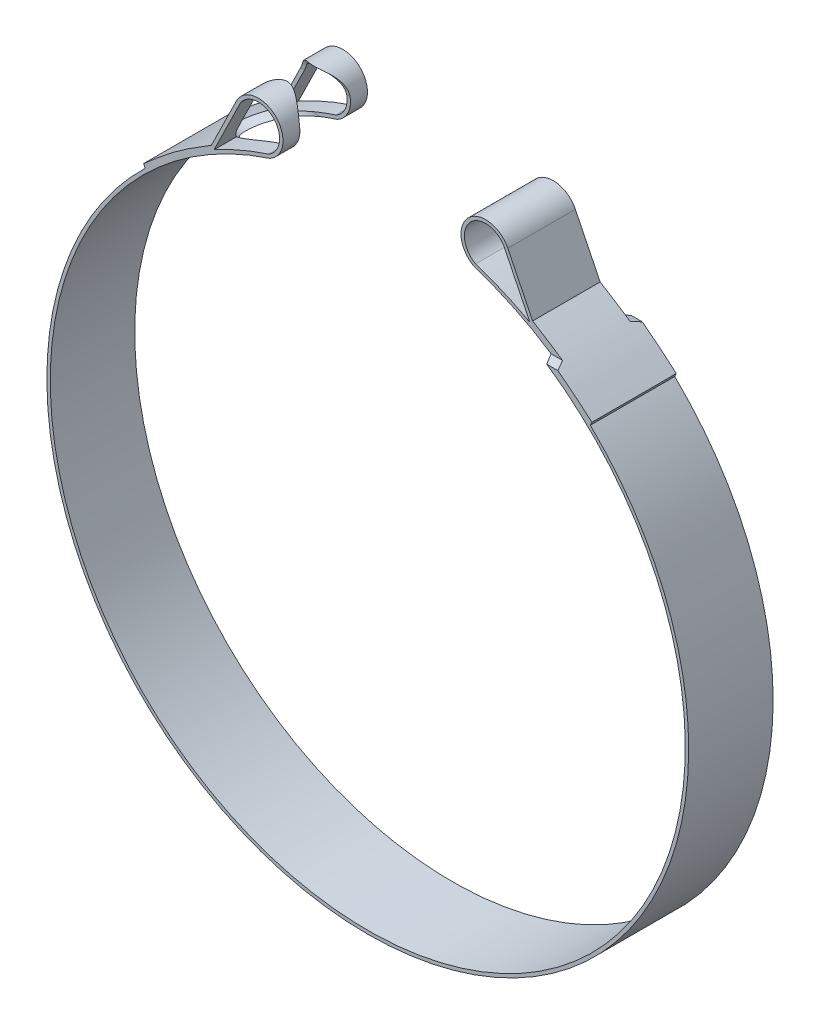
ISO-10303-21;
HEADER;
FILE_DESCRIPTION(('STEP AP214'),'2;1');
FILE_NAME('part.step','',(''),(''),'','','');
FILE_SCHEMA(('AUTOMOTIVE_DESIGN { 1 0 10303 214 1 1 1 1 }'));
ENDSEC;
DATA;
#1=APPLICATION_CONTEXT('core data for automotive mechanical design processes');
#2=APPLICATION_PROTOCOL_DEFINITION('international standard','automotive_design',2000,#1);
#3=PRODUCT_CONTEXT('',#1,'mechanical');
#4=PRODUCT('Part','Part','',(#3));
#5=PRODUCT_RELATED_PRODUCT_CATEGORY('part','',(#4));
#6=PRODUCT_DEFINITION_FORMATION('','',#4);
#7=PRODUCT_DEFINITION_CONTEXT('part definition',#1,'design');
#8=PRODUCT_DEFINITION('design','',#6,#7);
#9=PRODUCT_DEFINITION_SHAPE('','',#8);
#10=(LENGTH_UNIT() NAMED_UNIT(*) SI_UNIT(.MILLI.,.METRE.));
#11=(NAMED_UNIT(*) PLANE_ANGLE_UNIT() SI_UNIT($,.RADIAN.));
#12=(NAMED_UNIT(*) SI_UNIT($,.STERADIAN.) SOLID_ANGLE_UNIT());
#13=UNCERTAINTY_MEASURE_WITH_UNIT(LENGTH_MEASURE(1.E-05),#10,'distance_accuracy_value','');
#14=(GEOMETRIC_REPRESENTATION_CONTEXT(3) GLOBAL_UNCERTAINTY_ASSIGNED_CONTEXT((#13)) GLOBAL_UNIT_ASSIGNED_CONTEXT((#10,
#11,#12)) REPRESENTATION_CONTEXT('',''));
#15=CARTESIAN_POINT('',(0.,0.,0.));
#16=DIRECTION('',(0.,0.,1.));
#17=DIRECTION('',(1.,0.,0.));
#18=AXIS2_PLACEMENT_3D('',#15,#16,#17);
#19=CARTESIAN_POINT('',(-20.5729513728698,60.8854329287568,7.9375));
#20=DIRECTION('',(0.,0.,1.));
#21=DIRECTION('',(1.,0.,0.));
#22=AXIS2_PLACEMENT_3D('',#19,#20,#21);
#23=PLANE('',#22);
#24=DIRECTION('',(-0.440727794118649,-0.897640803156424,0.));
#25=VECTOR('',#24,1.);
#26=CARTESIAN_POINT('',(-23.9512748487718,63.0280786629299,7.9375));
#27=LINE('',#26,#25);
#28=CARTESIAN_POINT('',(-23.9512748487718,63.0280786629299,7.9375));
#29=VERTEX_POINT('',#28);
#30=CARTESIAN_POINT('',(-28.8980338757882,52.9528966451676,7.9375));
#31=VERTEX_POINT('',#30);
#32=EDGE_CURVE('E377',#29,#31,#27,.T.);
#33=ORIENTED_EDGE('',*,*,#32,.F.);
#34=CARTESIAN_POINT('',(-20.5729513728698,60.8854329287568,7.9375));
#35=DIRECTION('',(0.,0.,1.));
#36=DIRECTION('',(1.,0.,0.));
#37=AXIS2_PLACEMENT_3D('',#34,#35,#36);
#38=CIRCLE('',#37,4.0005);
#39=CARTESIAN_POINT('',(-18.6856193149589,57.3581141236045,7.9375));
#40=VERTEX_POINT('',#39);
#41=EDGE_CURVE('E462',#40,#29,#38,.T.);
#42=ORIENTED_EDGE('',*,*,#41,.F.);
#43=CARTESIAN_POINT('',(0.,0.,7.9375));
#44=DIRECTION('',(0.,0.,-1.));
#45=DIRECTION('',(1.,0.,0.));
#46=AXIS2_PLACEMENT_3D('',#43,#44,#45);
#47=CIRCLE('',#46,60.325);
#48=EDGE_CURVE('E470',#31,#40,#47,.T.);
#49=ORIENTED_EDGE('',*,*,#48,.F.);
#50=EDGE_LOOP('',(#33,#42,#49));
#51=FACE_BOUND('',#50,.T.);
#52=CARTESIAN_POINT('',(42.1281600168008,44.0911777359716,7.9375));
#53=CARTESIAN_POINT('',(40.0517796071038,45.888976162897,7.9375));
#54=CARTESIAN_POINT('',(36.0597040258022,49.3454464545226,7.9375));
#55=CARTESIAN_POINT('',(31.5583921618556,52.1044389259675,7.9375));
#56=CARTESIAN_POINT('',(29.3983274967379,53.428408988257,7.9375));
#57=B_SPLINE_CURVE_WITH_KNOTS('',3,(#52,#53,#54,#55,#56),.UNSPECIFIED.,.F.,.F.,(4,1,4),(0.,
0.520125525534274,1.),.UNSPECIFIED.);
#58=CARTESIAN_POINT('',(42.1281600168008,44.0911777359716,7.9375));
#59=VERTEX_POINT('',#58);
#60=CARTESIAN_POINT('',(35.7359641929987,49.3142511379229,7.9375));
#61=VERTEX_POINT('',#60);
#62=EDGE_CURVE('E381',#59,#61,#57,.T.);
#63=ORIENTED_EDGE('',*,*,#62,.T.);
#64=DIRECTION('',(-1.,0.,0.));
#65=VECTOR('',#64,1.);
#66=CARTESIAN_POINT('',(-20.5729513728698,49.3142511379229,7.9375));
#67=LINE('',#66,#65);
#68=CARTESIAN_POINT('',(33.6303543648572,49.3142511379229,7.93750000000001));
#69=VERTEX_POINT('',#68);
#70=EDGE_CURVE('E263',#61,#69,#67,.T.);
#71=ORIENTED_EDGE('',*,*,#70,.T.);
#72=CARTESIAN_POINT('',(0.,0.,7.9375));
#73=DIRECTION('',(0.,0.,-1.));
#74=DIRECTION('',(1.,0.,0.));
#75=AXIS2_PLACEMENT_3D('',#72,#73,#74);
#76=CIRCLE('',#75,59.69);
#77=CARTESIAN_POINT('',(-18.4376580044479,56.771021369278,7.9375));
#78=VERTEX_POINT('',#77);
#79=EDGE_CURVE('E387',#69,#78,#76,.T.);
#80=ORIENTED_EDGE('',*,*,#79,.T.);
#81=CARTESIAN_POINT('',(-20.5729513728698,60.8854329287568,7.9375));
#82=DIRECTION('',(0.,0.,1.));
#83=DIRECTION('',(1.,0.,0.));
#84=AXIS2_PLACEMENT_3D('',#81,#82,#83);
#85=CIRCLE('',#84,4.6355);
#86=CARTESIAN_POINT('',(-24.7339653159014,62.9284266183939,7.9375));
#87=VERTEX_POINT('',#86);
#88=EDGE_CURVE('E484',#78,#87,#85,.T.);
#89=ORIENTED_EDGE('',*,*,#88,.T.);
#90=DIRECTION('',(-0.440727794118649,-0.897640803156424,0.));
#91=VECTOR('',#90,1.);
#92=CARTESIAN_POINT('',(-24.7339653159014,62.9284266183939,7.9375));
#93=LINE('',#92,#91);
#94=CARTESIAN_POINT('',(-29.3983274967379,53.428408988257,7.9375));
#95=VERTEX_POINT('',#94);
#96=EDGE_CURVE('E487',#87,#95,#93,.T.);
#97=ORIENTED_EDGE('',*,*,#96,.T.);
#98=CARTESIAN_POINT('',(-29.3983274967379,53.428408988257,7.9375));
#99=CARTESIAN_POINT('',(-31.5583921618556,52.1044389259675,7.9375));
#100=CARTESIAN_POINT('',(-36.0597040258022,49.3454464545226,7.9375));
#101=CARTESIAN_POINT('',(-40.0517796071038,45.888976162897,7.9375));
#102=CARTESIAN_POINT('',(-42.1281600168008,44.0911777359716,7.9375));
#103=B_SPLINE_CURVE_WITH_KNOTS('',3,(#98,#99,#100,#101,#102),.UNSPECIFIED.,.F.,.F.,(4,1,4),(0.,
0.479874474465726,1.),.UNSPECIFIED.);
#104=CARTESIAN_POINT('',(-42.1281600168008,44.0911777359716,7.9375));
#105=VERTEX_POINT('',#104);
#106=EDGE_CURVE('E489',#95,#105,#103,.T.);
#107=ORIENTED_EDGE('',*,*,#106,.T.);
#108=DIRECTION('',(0.423855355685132,-0.905729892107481,0.));
#109=VECTOR('',#108,1.);
#110=CARTESIAN_POINT('',(-42.1281600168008,44.0911777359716,7.9375));
#111=LINE('',#110,#109);
#112=CARTESIAN_POINT('',(-41.8340934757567,43.4627915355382,7.9375));
#113=VERTEX_POINT('',#112);
#114=EDGE_CURVE('E494',#105,#113,#111,.T.);
#115=ORIENTED_EDGE('',*,*,#114,.T.);
#116=CARTESIAN_POINT('',(0.,0.,7.9375));
#117=DIRECTION('',(0.,0.,1.));
#118=DIRECTION('',(1.,0.,0.));
#119=AXIS2_PLACEMENT_3D('',#116,#117,#118);
#120=CIRCLE('',#119,60.325);
#121=CARTESIAN_POINT('',(41.8340934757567,43.4627915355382,7.9375));
#122=VERTEX_POINT('',#121);
#123=EDGE_CURVE('E390',#113,#122,#120,.T.);
#124=ORIENTED_EDGE('',*,*,#123,.T.);
#125=DIRECTION('',(0.423855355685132,0.905729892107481,0.));
#126=VECTOR('',#125,1.);
#127=CARTESIAN_POINT('',(42.1281600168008,44.0911777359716,7.9375));
#128=LINE('',#127,#126);
#129=EDGE_CURVE('E384',#122,#59,#128,.T.);
#130=ORIENTED_EDGE('',*,*,#129,.T.);
#131=EDGE_LOOP('',(#63,#71,#80,#89,#97,#107,#115,#124,#130));
#132=FACE_BOUND('',#131,.T.);
#133=ADVANCED_FACE('F31',(#51,#132),#23,.T.);
#134=DIRECTION('',(0.,0.,-1.));
#135=VECTOR('',#134,1.);
#136=SURFACE_OF_LINEAR_EXTRUSION('',#57,#135);
#137=CARTESIAN_POINT('',(42.1281600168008,44.0911777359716,-6.35));
#138=CARTESIAN_POINT('',(40.0517796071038,45.888976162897,-6.35));
#139=CARTESIAN_POINT('',(36.0597040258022,49.3454464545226,-6.35));
#140=CARTESIAN_POINT('',(31.5583921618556,52.1044389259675,-6.35));
#141=CARTESIAN_POINT('',(29.3983274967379,53.428408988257,-6.35));
#142=B_SPLINE_CURVE_WITH_KNOTS('',3,(#137,#138,#139,#140,#141),.UNSPECIFIED.,.F.,.F.,(4,1,4),
(0.,0.520125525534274,1.),.UNSPECIFIED.);
#143=CARTESIAN_POINT('',(29.3983274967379,53.428408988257,-6.35));
#144=VERTEX_POINT('',#143);
#145=CARTESIAN_POINT('',(35.030707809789,49.8168660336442,-6.35));
#146=VERTEX_POINT('',#145);
#147=EDGE_CURVE('E252',#144,#146,#142,.F.);
#148=ORIENTED_EDGE('',*,*,#147,.F.);
#149=DIRECTION('',(0.,0.,-1.));
#150=VECTOR('',#149,1.);
#151=CARTESIAN_POINT('',(29.3983274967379,53.428408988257,7.9375));
#152=LINE('',#151,#150);
#153=CARTESIAN_POINT('',(29.3983274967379,53.428408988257,6.35));
#154=VERTEX_POINT('',#153);
#155=EDGE_CURVE('E409',#154,#144,#152,.T.);
#156=ORIENTED_EDGE('',*,*,#155,.F.);
#157=CARTESIAN_POINT('',(42.1281600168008,44.0911777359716,6.35));
#158=CARTESIAN_POINT('',(40.0517796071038,45.888976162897,6.35));
#159=CARTESIAN_POINT('',(36.0597040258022,49.3454464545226,6.35));
#160=CARTESIAN_POINT('',(31.5583921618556,52.1044389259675,6.35));
#161=CARTESIAN_POINT('',(29.3983274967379,53.428408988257,6.35));
#162=B_SPLINE_CURVE_WITH_KNOTS('',3,(#157,#158,#159,#160,#161),.UNSPECIFIED.,.F.,.F.,(4,1,4),
(0.,0.520125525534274,1.),.UNSPECIFIED.);
#163=CARTESIAN_POINT('',(35.0307078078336,49.8168660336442,6.35));
#164=VERTEX_POINT('',#163);
#165=EDGE_CURVE('E907',#164,#154,#162,.T.);
#166=ORIENTED_EDGE('',*,*,#165,.F.);
#167=CARTESIAN_POINT('',(35.7359641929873,49.314251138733,7.93749999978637));
#168=CARTESIAN_POINT('',(35.6202033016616,49.398248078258,7.67219719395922));
#169=CARTESIAN_POINT('',(35.5035514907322,49.4821311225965,7.40725412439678));
#170=CARTESIAN_POINT('',(35.2684660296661,49.6496694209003,6.87808745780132));
#171=CARTESIAN_POINT('',(35.1500323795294,49.7333246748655,6.6138638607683));
#172=CARTESIAN_POINT('',(35.030707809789,49.8168660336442,6.35));
#173=B_SPLINE_CURVE_WITH_KNOTS('',3,(#167,#168,#169,#170,#171,#172),.UNSPECIFIED.,.F.,.F.,(4,2,
4),(0.,0.904184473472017,1.80836894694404),.UNSPECIFIED.);
#174=EDGE_CURVE('E639',#61,#164,#173,.T.);
#175=ORIENTED_EDGE('',*,*,#174,.F.);
#176=ORIENTED_EDGE('',*,*,#62,.F.);
#177=DIRECTION('',(0.,0.,-1.));
#178=VECTOR('',#177,1.);
#179=CARTESIAN_POINT('',(42.1281600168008,44.0911777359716,7.9375));
#180=LINE('',#179,#178);
#181=CARTESIAN_POINT('',(42.1281600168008,44.0911777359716,-7.9375));
#182=VERTEX_POINT('',#181);
#183=EDGE_CURVE('E411',#59,#182,#180,.T.);
#184=ORIENTED_EDGE('',*,*,#183,.T.);
#185=CARTESIAN_POINT('',(42.1281600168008,44.0911777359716,-7.9375));
#186=CARTESIAN_POINT('',(40.0517796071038,45.888976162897,-7.9375));
#187=CARTESIAN_POINT('',(36.0597040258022,49.3454464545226,-7.9375));
#188=CARTESIAN_POINT('',(31.5583921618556,52.1044389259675,-7.9375));
#189=CARTESIAN_POINT('',(29.3983274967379,53.428408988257,-7.9375));
#190=B_SPLINE_CURVE_WITH_KNOTS('',3,(#185,#186,#187,#188,#189),.UNSPECIFIED.,.F.,.F.,(4,1,4),
(0.,0.520125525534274,1.),.UNSPECIFIED.);
#191=CARTESIAN_POINT('',(35.7359641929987,49.3142511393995,-7.9375));
#192=VERTEX_POINT('',#191);
#193=EDGE_CURVE('E276',#182,#192,#190,.T.);
#194=ORIENTED_EDGE('',*,*,#193,.T.);
#195=CARTESIAN_POINT('',(35.030707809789,49.8168660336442,-6.35));
#196=CARTESIAN_POINT('',(35.1500323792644,49.7333246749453,-6.61386386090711));
#197=CARTESIAN_POINT('',(35.2684660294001,49.6496694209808,-6.87808745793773));
#198=CARTESIAN_POINT('',(35.5035514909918,49.4821311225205,-7.40725412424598));
#199=CARTESIAN_POINT('',(35.6202033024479,49.3982480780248,-7.67219719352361));
#200=CARTESIAN_POINT('',(35.7359641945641,49.3142511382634,-7.93749999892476));
#201=B_SPLINE_CURVE_WITH_KNOTS('',3,(#195,#196,#197,#198,#199,#200),.UNSPECIFIED.,.F.,.F.,(4,2,
4),(0.,0.904184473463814,1.80836894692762),.UNSPECIFIED.);
#202=EDGE_CURVE('E267',#146,#192,#201,.T.);
#203=ORIENTED_EDGE('',*,*,#202,.F.);
#204=EDGE_LOOP('',(#148,#156,#166,#175,#176,#184,#194,#203));
#205=FACE_BOUND('',#204,.T.);
#206=ADVANCED_FACE('F274',(#205),#136,.F.);
#207=CARTESIAN_POINT('',(24.7339653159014,62.9284266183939,7.9375));
#208=DIRECTION('',(-0.897640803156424,-0.440727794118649,0.));
#209=DIRECTION('',(0.440727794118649,-0.897640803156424,0.));
#210=AXIS2_PLACEMENT_3D('',#207,#208,#209);
#211=PLANE('',#210);
#212=DIRECTION('',(0.440727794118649,-0.897640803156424,0.));
#213=VECTOR('',#212,1.);
#214=CARTESIAN_POINT('',(24.7339653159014,62.9284266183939,-6.35));
#215=LINE('',#214,#213);
#216=CARTESIAN_POINT('',(24.7339653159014,62.9284266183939,-6.35));
#217=VERTEX_POINT('',#216);
#218=EDGE_CURVE('E258',#217,#144,#215,.T.);
#219=ORIENTED_EDGE('',*,*,#218,.F.);
#220=DIRECTION('',(0.,0.,-1.));
#221=VECTOR('',#220,1.);
#222=CARTESIAN_POINT('',(24.7339653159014,62.9284266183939,7.9375));
#223=LINE('',#222,#221);
#224=CARTESIAN_POINT('',(24.7339653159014,62.9284266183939,6.35));
#225=VERTEX_POINT('',#224);
#226=EDGE_CURVE('E406',#225,#217,#223,.T.);
#227=ORIENTED_EDGE('',*,*,#226,.F.);
#228=DIRECTION('',(-0.440727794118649,0.897640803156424,0.));
#229=VECTOR('',#228,1.);
#230=CARTESIAN_POINT('',(24.7339653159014,62.9284266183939,6.35));
#231=LINE('',#230,#229);
#232=EDGE_CURVE('E909',#154,#225,#231,.T.);
#233=ORIENTED_EDGE('',*,*,#232,.F.);
#234=ORIENTED_EDGE('',*,*,#155,.T.);
#235=EDGE_LOOP('',(#219,#227,#233,#234));
#236=FACE_BOUND('',#235,.T.);
#237=ADVANCED_FACE('F361',(#236),#211,.F.);
#238=CARTESIAN_POINT('',(20.5729513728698,60.8854329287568,7.9375));
#239=DIRECTION('',(0.,0.,-1.));
#240=DIRECTION('',(-1.,0.,0.));
#241=AXIS2_PLACEMENT_3D('',#238,#239,#240);
#242=CYLINDRICAL_SURFACE('',#241,4.6355);
#243=CARTESIAN_POINT('',(20.5729513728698,60.8854329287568,-6.35));
#244=DIRECTION('',(0.,0.,-1.));
#245=DIRECTION('',(-1.,0.,0.));
#246=AXIS2_PLACEMENT_3D('',#243,#244,#245);
#247=CIRCLE('',#246,4.6355);
#248=CARTESIAN_POINT('',(18.4376580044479,56.771021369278,-6.35));
#249=VERTEX_POINT('',#248);
#250=EDGE_CURVE('E928',#249,#217,#247,.T.);
#251=ORIENTED_EDGE('',*,*,#250,.F.);
#252=DIRECTION('',(0.,0.,-1.));
#253=VECTOR('',#252,1.);
#254=CARTESIAN_POINT('',(18.4376580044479,56.771021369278,7.9375));
#255=LINE('',#254,#253);
#256=CARTESIAN_POINT('',(18.4376580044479,56.771021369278,6.35));
#257=VERTEX_POINT('',#256);
#258=EDGE_CURVE('E403',#257,#249,#255,.T.);
#259=ORIENTED_EDGE('',*,*,#258,.F.);
#260=CARTESIAN_POINT('',(20.5729513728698,60.8854329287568,6.35));
#261=DIRECTION('',(0.,0.,1.));
#262=DIRECTION('',(1.,0.,0.));
#263=AXIS2_PLACEMENT_3D('',#260,#261,#262);
#264=CIRCLE('',#263,4.6355);
#265=EDGE_CURVE('E47',#225,#257,#264,.T.);
#266=ORIENTED_EDGE('',*,*,#265,.F.);
#267=ORIENTED_EDGE('',*,*,#226,.T.);
#268=EDGE_LOOP('',(#251,#259,#266,#267));
#269=FACE_BOUND('',#268,.T.);
#270=ADVANCED_FACE('F357',(#269),#242,.T.);
#271=CARTESIAN_POINT('',(0.,0.,7.9375));
#272=DIRECTION('',(0.,0.,-1.));
#273=DIRECTION('',(-1.,0.,0.));
#274=AXIS2_PLACEMENT_3D('',#271,#272,#273);
#275=CYLINDRICAL_SURFACE('',#274,59.69);
#276=CARTESIAN_POINT('',(0.,0.,-6.35));
#277=DIRECTION('',(0.,0.,-1.));
#278=DIRECTION('',(-1.,0.,0.));
#279=AXIS2_PLACEMENT_3D('',#276,#277,#278);
#280=CIRCLE('',#279,59.69);
#281=CARTESIAN_POINT('',(32.8812402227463,49.8168660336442,-6.35));
#282=VERTEX_POINT('',#281);
#283=EDGE_CURVE('E926',#282,#249,#280,.F.);
#284=ORIENTED_EDGE('',*,*,#283,.F.);
#285=CARTESIAN_POINT('',(0.,0.,-163.695664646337));
#286=DIRECTION('',(0.,0.953358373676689,-0.301840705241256));
#287=DIRECTION('',(0.,-0.301840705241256,-0.953358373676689));
#288=AXIS2_PLACEMENT_3D('',#285,#286,#287);
#289=ELLIPSE('',#288,197.753314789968,59.69);
#290=CARTESIAN_POINT('',(33.6303543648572,49.3142511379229,-7.9375));
#291=VERTEX_POINT('',#290);
#292=EDGE_CURVE('E270',#291,#282,#289,.F.);
#293=ORIENTED_EDGE('',*,*,#292,.F.);
#294=CARTESIAN_POINT('',(0.,0.,-7.9375));
#295=DIRECTION('',(0.,0.,-1.));
#296=DIRECTION('',(1.,0.,0.));
#297=AXIS2_PLACEMENT_3D('',#294,#295,#296);
#298=CIRCLE('',#297,59.69);
#299=CARTESIAN_POINT('',(-18.4376580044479,56.771021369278,-7.9375));
#300=VERTEX_POINT('',#299);
#301=EDGE_CURVE('E464',#291,#300,#298,.T.);
#302=ORIENTED_EDGE('',*,*,#301,.T.);
#303=DIRECTION('',(0.,0.,-1.));
#304=VECTOR('',#303,1.);
#305=CARTESIAN_POINT('',(-18.4376580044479,56.771021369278,7.9375));
#306=LINE('',#305,#304);
#307=CARTESIAN_POINT('',(-18.4376580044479,56.771021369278,-4.75452591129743));
#308=VERTEX_POINT('',#307);
#309=EDGE_CURVE('E388',#308,#300,#306,.T.);
#310=ORIENTED_EDGE('',*,*,#309,.F.);
#311=CARTESIAN_POINT('',(0.,0.,-4.75452591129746));
#312=DIRECTION('',(0.,0.,-1.));
#313=DIRECTION('',(0.,1.,0.));
#314=AXIS2_PLACEMENT_3D('',#311,#312,#313);
#315=CIRCLE('',#314,59.69);
#316=CARTESIAN_POINT('',(-21.7033069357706,55.6045193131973,-4.75452591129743));
#317=VERTEX_POINT('',#316);
#318=EDGE_CURVE('E543',#308,#317,#315,.F.);
#319=ORIENTED_EDGE('',*,*,#318,.T.);
#320=CARTESIAN_POINT('',(-21.7033069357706,55.6045193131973,-4.75452591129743));
#321=CARTESIAN_POINT('',(-21.9227815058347,55.518856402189,-4.74955172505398));
#322=CARTESIAN_POINT('',(-22.1417129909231,55.4319052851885,-4.74220073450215));
#323=CARTESIAN_POINT('',(-22.5783637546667,55.2554884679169,-4.72221371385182));
#324=CARTESIAN_POINT('',(-22.7960827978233,55.1660222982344,-4.70957669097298));
#325=CARTESIAN_POINT('',(-23.2309799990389,54.9843017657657,-4.67842461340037));
#326=CARTESIAN_POINT('',(-23.4481523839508,54.8920375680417,-4.65988593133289));
#327=CARTESIAN_POINT('',(-23.8808330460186,54.7051865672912,-4.61632156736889));
#328=CARTESIAN_POINT('',(-24.0963414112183,54.6105998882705,-4.59129623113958));
#329=CARTESIAN_POINT('',(-24.5336678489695,54.4155744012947,-4.53294822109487));
#330=CARTESIAN_POINT('',(-24.7554107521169,54.3150503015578,-4.49934402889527));
#331=CARTESIAN_POINT('',(-25.1964204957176,54.1118788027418,-4.42345056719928));
#332=CARTESIAN_POINT('',(-25.4156874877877,54.0092315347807,-4.38116183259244));
#333=CARTESIAN_POINT('',(-25.8509065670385,53.8022740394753,-4.28688389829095));
#334=CARTESIAN_POINT('',(-26.0668633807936,53.6979667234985,-4.23491026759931));
#335=CARTESIAN_POINT('',(-26.4951042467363,53.4879649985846,-4.1199400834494));
#336=CARTESIAN_POINT('',(-26.7073890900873,53.382270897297,-4.05694593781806));
#337=CARTESIAN_POINT('',(-27.1250183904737,53.1712664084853,-3.91916672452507));
#338=CARTESIAN_POINT('',(-27.3304145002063,53.0659655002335,-3.84452502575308));
#339=CARTESIAN_POINT('',(-27.7356425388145,52.8552965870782,-3.68108223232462));
#340=CARTESIAN_POINT('',(-27.9354721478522,52.7499285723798,-3.59227533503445));
#341=CARTESIAN_POINT('',(-28.3258912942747,52.5413027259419,-3.3991950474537));
#342=CARTESIAN_POINT('',(-28.5165497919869,52.4380343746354,-3.29507414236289));
#343=CARTESIAN_POINT('',(-28.8879279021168,52.234360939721,-3.06821783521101));
#344=CARTESIAN_POINT('',(-29.0686574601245,52.1339530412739,-2.94550154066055));
#345=CARTESIAN_POINT('',(-29.3979430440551,51.9489056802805,-2.69253415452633));
#346=CARTESIAN_POINT('',(-29.5478726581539,51.8637283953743,-2.56449326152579));
#347=CARTESIAN_POINT('',(-29.8330689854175,51.7002043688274,-2.28835200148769));
#348=CARTESIAN_POINT('',(-29.9683090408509,51.6218700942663,-2.1402162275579));
#349=CARTESIAN_POINT('',(-30.2195201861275,51.4752182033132,-1.81952974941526));
#350=CARTESIAN_POINT('',(-30.3352038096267,51.407051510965,-1.64667405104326));
#351=CARTESIAN_POINT('',(-30.4854020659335,51.3180261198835,-1.37080681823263));
#352=CARTESIAN_POINT('',(-30.531545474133,51.2905761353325,-1.27619085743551));
#353=CARTESIAN_POINT('',(-30.614829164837,51.240908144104,-1.08180036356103));
#354=CARTESIAN_POINT('',(-30.6519753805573,51.21868668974,-0.982029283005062));
#355=CARTESIAN_POINT('',(-30.7260708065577,51.1742818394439,-0.745799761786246));
#356=CARTESIAN_POINT('',(-30.7592612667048,51.1543218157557,-0.607696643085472));
#357=CARTESIAN_POINT('',(-30.8052371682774,51.1266487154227,-0.326982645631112));
#358=CARTESIAN_POINT('',(-30.8180379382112,51.1189264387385,-0.184375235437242));
#359=CARTESIAN_POINT('',(-30.8221719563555,51.1164340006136,0.101512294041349));
#360=CARTESIAN_POINT('',(-30.8134700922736,51.1216850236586,0.244793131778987));
#361=CARTESIAN_POINT('',(-30.7752906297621,51.1446777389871,0.527526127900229));
#362=CARTESIAN_POINT('',(-30.7458024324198,51.1624258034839,0.666976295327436));
#363=CARTESIAN_POINT('',(-30.6686549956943,51.2087069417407,0.937641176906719));
#364=CARTESIAN_POINT('',(-30.6211284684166,51.2371612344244,1.06890807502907));
#365=CARTESIAN_POINT('',(-30.5108565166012,51.3029031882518,1.32241226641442));
#366=CARTESIAN_POINT('',(-30.4481052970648,51.3401942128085,1.4446460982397));
#367=CARTESIAN_POINT('',(-30.2647947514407,51.4485734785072,1.75681262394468));
#368=CARTESIAN_POINT('',(-30.1333837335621,51.5257441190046,1.9383043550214));
#369=CARTESIAN_POINT('',(-29.9189536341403,51.650356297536,2.19098094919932));
#370=CARTESIAN_POINT('',(-29.8444353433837,51.6934588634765,2.27207982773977));
#371=CARTESIAN_POINT('',(-29.6905244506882,51.7820114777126,2.42815350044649));
#372=CARTESIAN_POINT('',(-29.6111328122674,51.8274610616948,2.50312949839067));
#373=CARTESIAN_POINT('',(-29.3911455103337,51.9526903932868,2.69795663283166));
#374=CARTESIAN_POINT('',(-29.2467050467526,52.0341745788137,2.81236656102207));
#375=CARTESIAN_POINT('',(-28.9490562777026,52.2003579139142,3.02655147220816));
#376=CARTESIAN_POINT('',(-28.7958415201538,52.2850594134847,3.12631548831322));
#377=CARTESIAN_POINT('',(-28.482531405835,52.4563955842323,3.31306732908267));
#378=CARTESIAN_POINT('',(-28.322426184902,52.5430329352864,3.40003599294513));
#379=CARTESIAN_POINT('',(-27.9969559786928,52.7171760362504,3.56260298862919));
#380=CARTESIAN_POINT('',(-27.8315889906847,52.8046821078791,3.63819692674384));
#381=CARTESIAN_POINT('',(-27.4970338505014,52.9796640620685,3.77916017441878));
#382=CARTESIAN_POINT('',(-27.327853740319,53.0671396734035,3.84454904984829));
#383=CARTESIAN_POINT('',(-26.9861625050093,53.2417124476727,3.96637994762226));
#384=CARTESIAN_POINT('',(-26.8136518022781,53.328809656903,4.02282309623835));
#385=CARTESIAN_POINT('',(-26.4657001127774,53.5023424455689,4.12776482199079));
#386=CARTESIAN_POINT('',(-26.2902565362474,53.5887773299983,4.17625591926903));
#387=CARTESIAN_POINT('',(-25.9370325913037,53.7606272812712,4.26603484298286));
#388=CARTESIAN_POINT('',(-25.7592519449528,53.8460422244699,4.30732180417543));
#389=CARTESIAN_POINT('',(-25.2224219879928,54.1006693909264,4.42155096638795));
#390=CARTESIAN_POINT('',(-24.8603845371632,54.2680143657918,4.4847154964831));
#391=CARTESIAN_POINT('',(-24.1307031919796,54.596386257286,4.58948580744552));
#392=CARTESIAN_POINT('',(-23.7630619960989,54.7574160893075,4.63110164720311));
#393=CARTESIAN_POINT('',(-23.1131649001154,55.0342652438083,4.68838735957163));
#394=CARTESIAN_POINT('',(-22.8318634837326,55.1515641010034,4.70790437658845));
#395=CARTESIAN_POINT('',(-22.2684353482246,55.3814510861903,4.73773664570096));
#396=CARTESIAN_POINT('',(-21.9863191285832,55.494059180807,4.74809576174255));
#397=CARTESIAN_POINT('',(-21.7033069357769,55.6045193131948,4.75452591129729));
#398=B_SPLINE_CURVE_WITH_KNOTS('',3,(#320,#321,#322,#323,#324,#325,#326,#327,#328,#329,#330,
#331,#332,#333,#334,#335,#336,#337,#338,#339,#340,#341,#342,#343,#344,#345,#346,#347,#348,#349,
#350,#351,#352,#353,#354,#355,#356,#357,#358,#359,#360,#361,#362,#363,#364,#365,#366,#367,#368,
#369,#370,#371,#372,#373,#374,#375,#376,#377,#378,#379,#380,#381,#382,#383,#384,#385,#386,#387,
#388,#389,#390,#391,#392,#393,#394,#395,#396,#397),.UNSPECIFIED.,.F.,.F.,(4,2,2,2,2,2,2,2,2,2,2,
2,2,2,2,2,2,2,2,2,2,2,2,2,2,2,2,2,2,2,2,2,2,2,2,2,2,2,4),(0.,0.706959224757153,1.41405128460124,
2.12401057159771,2.83393203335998,3.57109243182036,4.30820744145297,5.04414756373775,
5.77992709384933,6.50727615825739,7.2349239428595,7.95576355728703,8.67586744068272,
9.31894159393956,9.96316391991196,10.6161587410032,10.9419997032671,11.2676252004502,
11.6959724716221,12.1239975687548,12.5527220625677,12.9816653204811,13.4075120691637,
13.8335211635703,14.5401364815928,14.8947758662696,15.2493453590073,15.8527937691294,
16.456691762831,17.0614850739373,17.6665114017,18.2703630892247,18.8741386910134,
19.478478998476,20.0828918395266,21.2934459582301,22.5034344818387,23.4194701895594,
24.3310941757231),.UNSPECIFIED.);
#399=CARTESIAN_POINT('',(-21.7033069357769,55.6045193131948,4.75452591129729));
#400=VERTEX_POINT('',#399);
#401=EDGE_CURVE('E335',#317,#400,#398,.T.);
#402=ORIENTED_EDGE('',*,*,#401,.T.);
#403=CARTESIAN_POINT('',(0.,0.,4.67943174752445));
#404=DIRECTION('',(0.,-0.00135050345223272,0.999999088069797));
#405=DIRECTION('',(0.,-0.999999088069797,-0.00135050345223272));
#406=AXIS2_PLACEMENT_3D('',#403,#404,#405);
#407=ELLIPSE('',#406,59.6900544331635,59.69);
#408=CARTESIAN_POINT('',(-18.4376580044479,56.771021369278,4.75610127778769));
#409=VERTEX_POINT('',#408);
#410=EDGE_CURVE('E655',#400,#409,#407,.F.);
#411=ORIENTED_EDGE('',*,*,#410,.T.);
#412=EDGE_CURVE('E400',#78,#409,#306,.T.);
#413=ORIENTED_EDGE('',*,*,#412,.F.);
#414=ORIENTED_EDGE('',*,*,#79,.F.);
#415=CARTESIAN_POINT('',(0.,0.,163.695664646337));
#416=DIRECTION('',(0.,0.953358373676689,0.301840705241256));
#417=DIRECTION('',(0.,0.301840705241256,-0.953358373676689));
#418=AXIS2_PLACEMENT_3D('',#415,#416,#417);
#419=ELLIPSE('',#418,197.753314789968,59.69);
#420=CARTESIAN_POINT('',(32.8812402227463,49.8168660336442,6.35));
#421=VERTEX_POINT('',#420);
#422=EDGE_CURVE('E11',#421,#69,#419,.F.);
#423=ORIENTED_EDGE('',*,*,#422,.F.);
#424=CARTESIAN_POINT('',(0.,0.,6.35));
#425=DIRECTION('',(0.,0.,1.));
#426=DIRECTION('',(1.,0.,0.));
#427=AXIS2_PLACEMENT_3D('',#424,#425,#426);
#428=CIRCLE('',#427,59.69);
#429=EDGE_CURVE('E914',#257,#421,#428,.F.);
#430=ORIENTED_EDGE('',*,*,#429,.F.);
#431=ORIENTED_EDGE('',*,*,#258,.T.);
#432=EDGE_LOOP('',(#284,#293,#302,#310,#319,#402,#411,#413,#414,#423,#430,#431));
#433=FACE_BOUND('',#432,.T.);
#434=ADVANCED_FACE('F351',(#433),#275,.F.);
#435=CARTESIAN_POINT('',(-20.5729513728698,60.8854329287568,-7.9375));
#436=DIRECTION('',(0.,0.,1.));
#437=DIRECTION('',(1.,0.,0.));
#438=AXIS2_PLACEMENT_3D('',#435,#436,#437);
#439=PLANE('',#438);
#440=CARTESIAN_POINT('',(0.,0.,-7.9375));
#441=DIRECTION('',(0.,0.,-1.));
#442=DIRECTION('',(1.,0.,0.));
#443=AXIS2_PLACEMENT_3D('',#440,#441,#442);
#444=CIRCLE('',#443,60.325);
#445=CARTESIAN_POINT('',(-28.8980338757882,52.9528966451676,-7.9375));
#446=VERTEX_POINT('',#445);
#447=CARTESIAN_POINT('',(-18.6856193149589,57.3581141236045,-7.9375));
#448=VERTEX_POINT('',#447);
#449=EDGE_CURVE('E586',#446,#448,#444,.T.);
#450=ORIENTED_EDGE('',*,*,#449,.T.);
#451=CARTESIAN_POINT('',(-20.5729513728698,60.8854329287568,-7.9375));
#452=DIRECTION('',(0.,0.,1.));
#453=DIRECTION('',(1.,0.,0.));
#454=AXIS2_PLACEMENT_3D('',#451,#452,#453);
#455=CIRCLE('',#454,4.0005);
#456=CARTESIAN_POINT('',(-23.9512748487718,63.0280786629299,-7.9375));
#457=VERTEX_POINT('',#456);
#458=EDGE_CURVE('E580',#448,#457,#455,.T.);
#459=ORIENTED_EDGE('',*,*,#458,.T.);
#460=DIRECTION('',(-0.440727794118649,-0.897640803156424,0.));
#461=VECTOR('',#460,1.);
#462=CARTESIAN_POINT('',(-23.9512748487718,63.0280786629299,-7.9375));
#463=LINE('',#462,#461);
#464=EDGE_CURVE('E583',#457,#446,#463,.T.);
#465=ORIENTED_EDGE('',*,*,#464,.T.);
#466=EDGE_LOOP('',(#450,#459,#465));
#467=FACE_BOUND('',#466,.T.);
#468=DIRECTION('',(-1.,0.,0.));
#469=VECTOR('',#468,1.);
#470=CARTESIAN_POINT('',(-20.5729513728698,49.3142511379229,-7.9375));
#471=LINE('',#470,#469);
#472=EDGE_CURVE('E444',#192,#291,#471,.T.);
#473=ORIENTED_EDGE('',*,*,#472,.F.);
#474=ORIENTED_EDGE('',*,*,#193,.F.);
#475=DIRECTION('',(0.423855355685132,0.905729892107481,0.));
#476=VECTOR('',#475,1.);
#477=CARTESIAN_POINT('',(42.1281600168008,44.0911777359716,-7.9375));
#478=LINE('',#477,#476);
#479=CARTESIAN_POINT('',(41.8340934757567,43.4627915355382,-7.9375));
#480=VERTEX_POINT('',#479);
#481=EDGE_CURVE('E609',#480,#182,#478,.T.);
#482=ORIENTED_EDGE('',*,*,#481,.F.);
#483=CARTESIAN_POINT('',(0.,0.,-7.9375));
#484=DIRECTION('',(0.,0.,1.));
#485=DIRECTION('',(1.,0.,0.));
#486=AXIS2_PLACEMENT_3D('',#483,#484,#485);
#487=CIRCLE('',#486,60.325);
#488=CARTESIAN_POINT('',(-41.8340934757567,43.4627915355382,-7.9375));
#489=VERTEX_POINT('',#488);
#490=EDGE_CURVE('E606',#489,#480,#487,.T.);
#491=ORIENTED_EDGE('',*,*,#490,.F.);
#492=DIRECTION('',(0.423855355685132,-0.905729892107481,0.));
#493=VECTOR('',#492,1.);
#494=CARTESIAN_POINT('',(-42.1281600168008,44.0911777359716,-7.9375));
#495=LINE('',#494,#493);
#496=CARTESIAN_POINT('',(-42.1281600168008,44.0911777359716,-7.9375));
#497=VERTEX_POINT('',#496);
#498=EDGE_CURVE('E600',#497,#489,#495,.T.);
#499=ORIENTED_EDGE('',*,*,#498,.F.);
#500=CARTESIAN_POINT('',(-29.3983274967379,53.428408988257,-7.9375));
#501=CARTESIAN_POINT('',(-31.5583921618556,52.1044389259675,-7.9375));
#502=CARTESIAN_POINT('',(-36.0597040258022,49.3454464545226,-7.9375));
#503=CARTESIAN_POINT('',(-40.0517796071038,45.888976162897,-7.9375));
#504=CARTESIAN_POINT('',(-42.1281600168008,44.0911777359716,-7.9375));
#505=B_SPLINE_CURVE_WITH_KNOTS('',3,(#500,#501,#502,#503,#504),.UNSPECIFIED.,.F.,.F.,(4,1,4),
(0.,0.479874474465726,1.),.UNSPECIFIED.);
#506=CARTESIAN_POINT('',(-29.3983274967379,53.428408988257,-7.9375));
#507=VERTEX_POINT('',#506);
#508=EDGE_CURVE('E595',#507,#497,#505,.T.);
#509=ORIENTED_EDGE('',*,*,#508,.F.);
#510=DIRECTION('',(-0.440727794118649,-0.897640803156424,0.));
#511=VECTOR('',#510,1.);
#512=CARTESIAN_POINT('',(-24.7339653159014,62.9284266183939,-7.9375));
#513=LINE('',#512,#511);
#514=CARTESIAN_POINT('',(-24.7339653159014,62.9284266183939,-7.9375));
#515=VERTEX_POINT('',#514);
#516=EDGE_CURVE('E592',#515,#507,#513,.T.);
#517=ORIENTED_EDGE('',*,*,#516,.F.);
#518=CARTESIAN_POINT('',(-20.5729513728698,60.8854329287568,-7.9375));
#519=DIRECTION('',(0.,0.,1.));
#520=DIRECTION('',(1.,0.,0.));
#521=AXIS2_PLACEMENT_3D('',#518,#519,#520);
#522=CIRCLE('',#521,4.6355);
#523=EDGE_CURVE('E589',#300,#515,#522,.T.);
#524=ORIENTED_EDGE('',*,*,#523,.F.);
#525=ORIENTED_EDGE('',*,*,#301,.F.);
#526=EDGE_LOOP('',(#473,#474,#482,#491,#499,#509,#517,#524,#525));
#527=FACE_BOUND('',#526,.T.);
#528=ADVANCED_FACE('F356',(#467,#527),#439,.F.);
#529=CARTESIAN_POINT('',(-20.5729513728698,60.8854329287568,7.9375));
#530=DIRECTION('',(0.,0.,-1.));
#531=DIRECTION('',(-1.,0.,0.));
#532=AXIS2_PLACEMENT_3D('',#529,#530,#531);
#533=CYLINDRICAL_SURFACE('',#532,4.6355);
#534=DIRECTION('',(0.,0.,-1.));
#535=VECTOR('',#534,1.);
#536=CARTESIAN_POINT('',(-24.7339653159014,62.9284266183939,7.9375));
#537=LINE('',#536,#535);
#538=CARTESIAN_POINT('',(-24.7339653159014,62.9284266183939,-4.53305198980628));
#539=VERTEX_POINT('',#538);
#540=EDGE_CURVE('E423',#539,#515,#537,.T.);
#541=ORIENTED_EDGE('',*,*,#540,.F.);
#542=CARTESIAN_POINT('',(-24.7339653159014,62.9284266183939,-4.53305198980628));
#543=CARTESIAN_POINT('',(-24.6744393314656,63.049674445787,-4.49399999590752));
#544=CARTESIAN_POINT('',(-24.6101926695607,63.1671262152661,-4.45078245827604));
#545=CARTESIAN_POINT('',(-24.4733415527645,63.3938803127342,-4.35744964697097));
#546=CARTESIAN_POINT('',(-24.4007510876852,63.5031957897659,-4.30734589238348));
#547=CARTESIAN_POINT('',(-24.2485976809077,63.7128274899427,-4.20188592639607));
#548=CARTESIAN_POINT('',(-24.1690840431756,63.8131984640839,-4.14656665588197));
#549=CARTESIAN_POINT('',(-24.0033939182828,64.0056986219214,-4.03163247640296));
#550=CARTESIAN_POINT('',(-23.917214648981,64.0978243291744,-3.97201577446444));
#551=CARTESIAN_POINT('',(-23.739399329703,64.2731991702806,-3.85014154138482));
#552=CARTESIAN_POINT('',(-23.6478037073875,64.3565036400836,-3.78790437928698));
#553=CARTESIAN_POINT('',(-23.4590194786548,64.5149867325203,-3.66163111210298));
#554=CARTESIAN_POINT('',(-23.361831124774,64.5901657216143,-3.59759508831));
#555=CARTESIAN_POINT('',(-23.1618073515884,64.7326137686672,-3.46885188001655));
#556=CARTESIAN_POINT('',(-23.0589593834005,64.7998641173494,-3.4041434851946));
#557=CARTESIAN_POINT('',(-22.8478312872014,64.9262130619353,-3.27571256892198));
#558=CARTESIAN_POINT('',(-22.7395521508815,64.9853131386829,-3.2119898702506));
#559=CARTESIAN_POINT('',(-22.4626184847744,65.1223331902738,-3.05656157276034));
#560=CARTESIAN_POINT('',(-22.2904728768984,65.195203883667,-2.96651571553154));
#561=CARTESIAN_POINT('',(-21.9325411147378,65.3211080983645,-2.80102235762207));
#562=CARTESIAN_POINT('',(-21.7467893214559,65.3741896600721,-2.72553972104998));
#563=CARTESIAN_POINT('',(-21.4143029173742,65.4461754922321,-2.61887645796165));
#564=CARTESIAN_POINT('',(-21.2708889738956,65.4704644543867,-2.58122102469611));
#565=CARTESIAN_POINT('',(-20.9787420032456,65.5054666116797,-2.52613966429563));
#566=CARTESIAN_POINT('',(-20.8300232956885,65.5162138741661,-2.50866298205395));
#567=CARTESIAN_POINT('',(-20.5305112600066,65.5231672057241,-2.49741735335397));
#568=CARTESIAN_POINT('',(-20.3797111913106,65.5192980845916,-2.50377099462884));
#569=CARTESIAN_POINT('',(-20.0817631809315,65.4972694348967,-2.53905097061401));
#570=CARTESIAN_POINT('',(-19.9346232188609,65.4790810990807,-2.56802280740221));
#571=CARTESIAN_POINT('',(-19.5917356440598,65.420405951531,-2.65775295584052));
#572=CARTESIAN_POINT('',(-19.3991410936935,65.3740228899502,-2.72646304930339));
#573=CARTESIAN_POINT('',(-19.1211723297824,65.2888031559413,-2.84345711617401));
#574=CARTESIAN_POINT('',(-19.0301396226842,65.2576992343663,-2.88488823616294));
#575=CARTESIAN_POINT('',(-18.8515440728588,65.1905115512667,-2.97107574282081));
#576=CARTESIAN_POINT('',(-18.7639804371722,65.1544289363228,-3.01583136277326));
#577=CARTESIAN_POINT('',(-18.5444658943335,65.0561123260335,-3.13297086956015));
#578=CARTESIAN_POINT('',(-18.4148604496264,64.9904809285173,-3.20689899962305));
#579=CARTESIAN_POINT('',(-18.1631617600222,64.8479687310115,-3.35677479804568));
#580=CARTESIAN_POINT('',(-18.0410724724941,64.7710820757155,-3.43272350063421));
#581=CARTESIAN_POINT('',(-17.804461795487,64.6061978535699,-3.58408046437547));
#582=CARTESIAN_POINT('',(-17.6899338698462,64.5182100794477,-3.65948914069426));
#583=CARTESIAN_POINT('',(-17.4686935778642,64.3310719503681,-3.80768707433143));
#584=CARTESIAN_POINT('',(-17.361977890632,64.2319263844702,-3.88047743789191));
#585=CARTESIAN_POINT('',(-17.0999119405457,63.9640498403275,-4.06075518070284));
#586=CARTESIAN_POINT('',(-16.9504468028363,63.7872418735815,-4.165074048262));
#587=CARTESIAN_POINT('',(-16.6761243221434,63.4068235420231,-4.35516680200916));
#588=CARTESIAN_POINT('',(-16.5512239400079,63.2032611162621,-4.44097314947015));
#589=CARTESIAN_POINT('',(-16.3524756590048,62.8125648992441,-4.57247268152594));
#590=CARTESIAN_POINT('',(-16.2734372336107,62.6296491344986,-4.62268862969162));
#591=CARTESIAN_POINT('',(-16.1723543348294,62.3458227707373,-4.68190328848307));
#592=CARTESIAN_POINT('',(-16.1415665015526,62.2496110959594,-4.69895907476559));
#593=CARTESIAN_POINT('',(-16.0861759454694,62.0546039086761,-4.7272603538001));
#594=CARTESIAN_POINT('',(-16.0615706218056,61.9558095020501,-4.73850829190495));
#595=CARTESIAN_POINT('',(-16.0187293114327,61.7557487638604,-4.75486490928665));
#596=CARTESIAN_POINT('',(-16.0005306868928,61.6544715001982,-4.75993798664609));
#597=CARTESIAN_POINT('',(-15.9709150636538,61.450852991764,-4.76355686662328));
#598=CARTESIAN_POINT('',(-15.9594951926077,61.3485122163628,-4.76210543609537));
#599=CARTESIAN_POINT('',(-15.9435051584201,61.1436000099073,-4.75254582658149));
#600=CARTESIAN_POINT('',(-15.9389354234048,61.0410285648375,-4.74443723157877));
#601=CARTESIAN_POINT('',(-15.9365815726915,60.8365567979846,-4.72157478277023));
#602=CARTESIAN_POINT('',(-15.9387971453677,60.734656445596,-4.70682123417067));
#603=CARTESIAN_POINT('',(-15.9493413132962,60.540917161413,-4.67234100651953));
#604=CARTESIAN_POINT('',(-15.9571381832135,60.4489549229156,-4.65313915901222));
#605=CARTESIAN_POINT('',(-15.9779912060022,60.2668776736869,-4.60949986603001));
#606=CARTESIAN_POINT('',(-15.9910489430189,60.1767632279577,-4.58506084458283));
#607=CARTESIAN_POINT('',(-16.03764789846,59.9100389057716,-4.50428716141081));
#608=CARTESIAN_POINT('',(-16.0786228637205,59.7369146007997,-4.44047172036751));
#609=CARTESIAN_POINT('',(-16.1925510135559,59.3518759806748,-4.27318258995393));
#610=CARTESIAN_POINT('',(-16.2714668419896,59.1444416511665,-4.1635479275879));
#611=CARTESIAN_POINT('',(-16.4508594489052,58.7541120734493,-3.92037196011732));
#612=CARTESIAN_POINT('',(-16.5513829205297,58.5712713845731,-3.78677898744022));
#613=CARTESIAN_POINT('',(-16.7311017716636,58.2881181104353,-3.54847290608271));
#614=CARTESIAN_POINT('',(-16.8062142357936,58.1806316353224,-3.44900714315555));
#615=CARTESIAN_POINT('',(-16.961251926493,57.9768471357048,-3.24257525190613));
#616=CARTESIAN_POINT('',(-17.0411783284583,57.8805518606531,-3.13560729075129));
#617=CARTESIAN_POINT('',(-17.20406778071,57.6989991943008,-2.91487070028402));
#618=CARTESIAN_POINT('',(-17.287030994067,57.6137423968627,-2.80110170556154));
#619=CARTESIAN_POINT('',(-17.4541887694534,57.4540288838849,-2.56700800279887));
#620=CARTESIAN_POINT('',(-17.5383836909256,57.3795753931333,-2.44668135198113));
#621=CARTESIAN_POINT('',(-17.6997186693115,57.2464043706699,-2.20834750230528));
#622=CARTESIAN_POINT('',(-17.7769276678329,57.186937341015,-2.09080457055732));
#623=CARTESIAN_POINT('',(-17.9281426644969,57.0773458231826,-1.84962080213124));
#624=CARTESIAN_POINT('',(-18.0021524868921,57.0272099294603,-1.7259876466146));
#625=CARTESIAN_POINT('',(-18.108282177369,56.9592330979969,-1.53524379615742));
#626=CARTESIAN_POINT('',(-18.1428497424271,56.9377757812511,-1.47076934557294));
#627=CARTESIAN_POINT('',(-18.2097524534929,56.8973663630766,-1.33992652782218));
#628=CARTESIAN_POINT('',(-18.242088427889,56.8784133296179,-1.27355887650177));
#629=CARTESIAN_POINT('',(-18.3039598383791,56.843056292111,-1.13850559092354));
#630=CARTESIAN_POINT('',(-18.3334835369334,56.8266628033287,-1.06981173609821));
#631=CARTESIAN_POINT('',(-18.3886957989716,56.7966812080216,-0.930204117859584));
#632=CARTESIAN_POINT('',(-18.41437924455,56.7830968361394,-0.859287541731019));
#633=CARTESIAN_POINT('',(-18.4376580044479,56.771021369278,-0.787272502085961));
#634=B_SPLINE_CURVE_WITH_KNOTS('',3,(#542,#543,#544,#545,#546,#547,#548,#549,#550,#551,#552,
#553,#554,#555,#556,#557,#558,#559,#560,#561,#562,#563,#564,#565,#566,#567,#568,#569,#570,#571,
#572,#573,#574,#575,#576,#577,#578,#579,#580,#581,#582,#583,#584,#585,#586,#587,#588,#589,#590,
#591,#592,#593,#594,#595,#596,#597,#598,#599,#600,#601,#602,#603,#604,#605,#606,#607,#608,#609,
#610,#611,#612,#613,#614,#615,#616,#617,#618,#619,#620,#621,#622,#623,#624,#625,#626,#627,#628,
#629,#630,#631,#632,#633),.UNSPECIFIED.,.F.,.F.,(4,2,2,2,2,2,2,2,2,2,2,2,2,2,2,2,2,2,2,2,2,2,2,
2,2,2,2,2,2,2,2,2,2,2,2,2,2,2,2,2,2,2,2,2,2,4),(0.,0.421450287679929,0.842203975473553,
1.26017413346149,1.67831969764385,2.09366377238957,2.50898910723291,2.92527566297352,
3.34148648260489,3.96250127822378,4.58199851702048,5.03110543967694,5.4790802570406,
5.92936269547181,6.38055332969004,7.00585041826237,7.31994914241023,7.63397565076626,
8.12233805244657,8.61095542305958,9.09914474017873,9.58712531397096,10.3459785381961,
11.1034901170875,11.7171881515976,12.0242040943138,12.3310906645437,12.6397383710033,
12.9482552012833,13.2567913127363,13.5653132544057,13.8477957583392,14.1303633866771,
14.6950958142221,15.4337994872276,16.1741158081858,16.667287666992,17.1605804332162,
17.6538997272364,18.1473659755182,18.6050572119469,19.0621852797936,19.2908229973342,
19.5193753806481,19.7488433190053,19.9786143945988),.UNSPECIFIED.);
#635=CARTESIAN_POINT('',(-16.0175573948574,61.7434806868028,-4.75452591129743));
#636=VERTEX_POINT('',#635);
#637=EDGE_CURVE('E574',#539,#636,#634,.T.);
#638=ORIENTED_EDGE('',*,*,#637,.T.);
#639=CARTESIAN_POINT('',(-20.5729513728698,60.8854329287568,-4.75452591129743));
#640=DIRECTION('',(0.,0.,-1.));
#641=DIRECTION('',(0.,1.,0.));
#642=AXIS2_PLACEMENT_3D('',#639,#640,#641);
#643=CIRCLE('',#642,4.6355);
#644=EDGE_CURVE('E538',#636,#308,#643,.T.);
#645=ORIENTED_EDGE('',*,*,#644,.T.);
#646=ORIENTED_EDGE('',*,*,#309,.T.);
#647=ORIENTED_EDGE('',*,*,#523,.T.);
#648=EDGE_LOOP('',(#541,#638,#645,#646,#647));
#649=FACE_BOUND('',#648,.T.);
#650=ADVANCED_FACE('F514',(#649),#533,.T.);
#651=CARTESIAN_POINT('',(-24.7339653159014,62.9284266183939,7.9375));
#652=DIRECTION('',(0.897640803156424,-0.440727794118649,0.));
#653=DIRECTION('',(0.440727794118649,0.897640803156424,0.));
#654=AXIS2_PLACEMENT_3D('',#651,#652,#653);
#655=PLANE('',#654);
#656=DIRECTION('',(0.440727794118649,0.897640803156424,0.));
#657=VECTOR('',#656,1.);
#658=CARTESIAN_POINT('',(-24.7339653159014,62.9284266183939,-4.75452591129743));
#659=LINE('',#658,#657);
#660=CARTESIAN_POINT('',(-28.3298908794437,55.6045193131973,-4.75452591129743));
#661=VERTEX_POINT('',#660);
#662=CARTESIAN_POINT('',(-25.3157554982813,61.7434806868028,-4.75452591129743));
#663=VERTEX_POINT('',#662);
#664=EDGE_CURVE('E529',#661,#663,#659,.T.);
#665=ORIENTED_EDGE('',*,*,#664,.T.);
#666=CARTESIAN_POINT('',(-25.4510122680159,61.468,0.));
#667=DIRECTION('',(0.897640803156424,-0.440727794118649,0.));
#668=DIRECTION('',(0.440727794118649,0.897640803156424,0.));
#669=AXIS2_PLACEMENT_3D('',#666,#667,#668);
#670=ELLIPSE('',#669,5.30557432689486,4.7625);
#671=EDGE_CURVE('E530',#663,#539,#670,.T.);
#672=ORIENTED_EDGE('',*,*,#671,.T.);
#673=ORIENTED_EDGE('',*,*,#540,.T.);
#674=ORIENTED_EDGE('',*,*,#516,.T.);
#675=DIRECTION('',(0.,0.,-1.));
#676=VECTOR('',#675,1.);
#677=CARTESIAN_POINT('',(-29.3983274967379,53.428408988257,7.9375));
#678=LINE('',#677,#676);
#679=CARTESIAN_POINT('',(-29.3983274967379,53.428408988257,-4.08302678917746));
#680=VERTEX_POINT('',#679);
#681=EDGE_CURVE('E419',#680,#507,#678,.T.);
#682=ORIENTED_EDGE('',*,*,#681,.F.);
#683=CARTESIAN_POINT('',(-28.1946341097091,55.88,0.));
#684=DIRECTION('',(0.897640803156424,-0.440727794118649,0.));
#685=DIRECTION('',(0.440727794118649,0.897640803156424,0.));
#686=AXIS2_PLACEMENT_3D('',#683,#684,#685);
#687=ELLIPSE('',#686,5.30557432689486,4.7625);
#688=EDGE_CURVE('E533',#680,#661,#687,.T.);
#689=ORIENTED_EDGE('',*,*,#688,.T.);
#690=EDGE_LOOP('',(#665,#672,#673,#674,#682,#689));
#691=FACE_BOUND('',#690,.T.);
#692=ADVANCED_FACE('F508',(#691),#655,.F.);
#693=CARTESIAN_POINT('',(-20.5729513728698,60.8854329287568,7.9375));
#694=DIRECTION('',(0.,0.,-1.));
#695=DIRECTION('',(-1.,0.,0.));
#696=AXIS2_PLACEMENT_3D('',#693,#694,#695);
#697=CYLINDRICAL_SURFACE('',#696,4.0005);
#698=CARTESIAN_POINT('',(-23.9512748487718,63.0280786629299,-4.49972897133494));
#699=CARTESIAN_POINT('',(-23.8874218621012,63.128745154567,-4.46483760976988));
#700=CARTESIAN_POINT('',(-23.8195226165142,63.2258660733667,-4.42737226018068));
#701=CARTESIAN_POINT('',(-23.6763285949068,63.4126640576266,-4.34855479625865));
#702=CARTESIAN_POINT('',(-23.6010405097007,63.5023477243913,-4.30720619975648));
#703=CARTESIAN_POINT('',(-23.4433198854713,63.674459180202,-4.22163792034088));
#704=CARTESIAN_POINT('',(-23.3608587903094,63.7568550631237,-4.17740695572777));
#705=CARTESIAN_POINT('',(-23.1895074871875,63.9138222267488,-4.08748602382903));
#706=CARTESIAN_POINT('',(-23.1006157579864,63.9883916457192,-4.04179571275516));
#707=CARTESIAN_POINT('',(-22.9169801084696,64.1293322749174,-3.95041063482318));
#708=CARTESIAN_POINT('',(-22.8222527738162,64.195725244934,-3.90471621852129));
#709=CARTESIAN_POINT('',(-22.6270005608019,64.320299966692,-3.81467129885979));
#710=CARTESIAN_POINT('',(-22.5264752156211,64.3784810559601,-3.77032090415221));
#711=CARTESIAN_POINT('',(-22.2167396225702,64.5400238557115,-3.64182027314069));
#712=CARTESIAN_POINT('',(-21.9987580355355,64.6308574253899,-3.56189630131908));
#713=CARTESIAN_POINT('',(-21.6150065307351,64.7512770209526,-3.4505102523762));
#714=CARTESIAN_POINT('',(-21.4545751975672,64.7911500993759,-3.41171684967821));
#715=CARTESIAN_POINT('',(-21.1268706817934,64.850879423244,-3.35251206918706));
#716=CARTESIAN_POINT('',(-20.9596140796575,64.8707814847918,-3.33205862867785));
#717=CARTESIAN_POINT('',(-20.621730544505,64.8892264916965,-3.31313065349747));
#718=CARTESIAN_POINT('',(-20.4510905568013,64.8876571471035,-3.31477166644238));
#719=CARTESIAN_POINT('',(-20.1129224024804,64.8630210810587,-3.3399849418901));
#720=CARTESIAN_POINT('',(-19.9453986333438,64.8399260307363,-3.36358610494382));
#721=CARTESIAN_POINT('',(-19.5858518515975,64.7673927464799,-3.43488397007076));
#722=CARTESIAN_POINT('',(-19.3954870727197,64.7136682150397,-3.48640553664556));
#723=CARTESIAN_POINT('',(-19.0287799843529,64.5810730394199,-3.60528215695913));
#724=CARTESIAN_POINT('',(-18.8524749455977,64.502138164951,-3.67267753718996));
#725=CARTESIAN_POINT('',(-18.5776476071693,64.3549110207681,-3.78845965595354));
#726=CARTESIAN_POINT('',(-18.4744440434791,64.2934528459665,-3.83467533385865));
#727=CARTESIAN_POINT('',(-18.2743140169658,64.1618067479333,-3.92827504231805));
#728=CARTESIAN_POINT('',(-18.177389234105,64.0916165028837,-3.97565938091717));
#729=CARTESIAN_POINT('',(-17.8965421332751,63.8683808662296,-4.11709699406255));
#730=CARTESIAN_POINT('',(-17.7222073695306,63.7024878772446,-4.21058774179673));
#731=CARTESIAN_POINT('',(-17.4306742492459,63.3694536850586,-4.36966604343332));
#732=CARTESIAN_POINT('',(-17.3088021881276,63.2073502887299,-4.43729312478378));
#733=CARTESIAN_POINT('',(-17.0891641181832,62.862510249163,-4.55740217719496));
#734=CARTESIAN_POINT('',(-16.9913618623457,62.6798052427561,-4.60990694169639));
#735=CARTESIAN_POINT('',(-16.8366756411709,62.3261549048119,-4.68749879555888));
#736=CARTESIAN_POINT('',(-16.775846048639,62.1575881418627,-4.715525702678));
#737=CARTESIAN_POINT('',(-16.6770627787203,61.8118785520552,-4.753242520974));
#738=CARTESIAN_POINT('',(-16.6390969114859,61.6347403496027,-4.76294220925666));
#739=CARTESIAN_POINT('',(-16.5874905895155,61.2764970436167,-4.76202561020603));
#740=CARTESIAN_POINT('',(-16.5739135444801,61.0953828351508,-4.75135651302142));
#741=CARTESIAN_POINT('',(-16.5712134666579,60.7353884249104,-4.70930384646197));
#742=CARTESIAN_POINT('',(-16.5820958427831,60.5565087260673,-4.67791569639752));
#743=CARTESIAN_POINT('',(-16.6257089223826,60.2130356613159,-4.59743550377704));
#744=CARTESIAN_POINT('',(-16.657581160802,60.0481573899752,-4.54907262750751));
#745=CARTESIAN_POINT('',(-16.7397546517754,59.728789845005,-4.43680577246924));
#746=CARTESIAN_POINT('',(-16.7900530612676,59.5742989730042,-4.37290419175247));
#747=CARTESIAN_POINT('',(-16.9289692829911,59.2197729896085,-4.20463254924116));
#748=CARTESIAN_POINT('',(-17.0248812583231,59.0254749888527,-4.09419937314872));
#749=CARTESIAN_POINT('',(-17.2403247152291,58.6622529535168,-3.85446515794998));
#750=CARTESIAN_POINT('',(-17.3599718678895,58.4934606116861,-3.72507256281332));
#751=CARTESIAN_POINT('',(-17.5752045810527,58.2328818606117,-3.49782868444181));
#752=CARTESIAN_POINT('',(-17.6659383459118,58.1339180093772,-3.40342692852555));
#753=CARTESIAN_POINT('',(-17.8544711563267,57.9474991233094,-3.21021947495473));
#754=CARTESIAN_POINT('',(-17.9522752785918,57.8600524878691,-3.11141063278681));
#755=CARTESIAN_POINT('',(-18.1528379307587,57.697404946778,-2.91210472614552));
#756=CARTESIAN_POINT('',(-18.2555211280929,57.6220672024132,-2.8116431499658));
#757=CARTESIAN_POINT('',(-18.4137037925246,57.5171033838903,-2.65999904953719));
#758=CARTESIAN_POINT('',(-18.467082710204,57.4834781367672,-2.60933077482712));
#759=CARTESIAN_POINT('',(-18.5752709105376,57.4188445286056,-2.50786117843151));
#760=CARTESIAN_POINT('',(-18.6300800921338,57.3878359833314,-2.4570598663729));
#761=CARTESIAN_POINT('',(-18.6856193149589,57.3581141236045,-2.40629265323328));
#762=B_SPLINE_CURVE_WITH_KNOTS('',3,(#698,#699,#700,#701,#702,#703,#704,#705,#706,#707,#708,
#709,#710,#711,#712,#713,#714,#715,#716,#717,#718,#719,#720,#721,#722,#723,#724,#725,#726,#727,
#728,#729,#730,#731,#732,#733,#734,#735,#736,#737,#738,#739,#740,#741,#742,#743,#744,#745,#746,
#747,#748,#749,#750,#751,#752,#753,#754,#755,#756,#757,#758,#759,#760,#761),.UNSPECIFIED.,.F.,
.F.,(4,2,2,2,2,2,2,2,2,2,2,2,2,2,2,2,2,2,2,2,2,2,2,2,2,2,2,2,2,2,2,4),(0.,0.372388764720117,
0.744443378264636,1.11805362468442,1.49175254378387,1.86443440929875,2.23714632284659,
2.98008344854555,3.48763974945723,3.99402896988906,4.50306748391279,5.01277686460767,
5.62269178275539,6.23417319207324,6.61984639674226,7.00562237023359,7.77594433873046,
8.4148939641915,9.05287541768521,9.59469198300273,10.1362194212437,10.6791527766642,
11.2222062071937,11.7443239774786,12.2663612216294,12.9920020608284,13.7212701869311,
14.2130640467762,14.7052146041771,15.1913387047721,15.4340367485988,15.6767176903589),.UNSPECIFIED.);
#763=CARTESIAN_POINT('',(-23.9512748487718,63.0280786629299,-4.49972897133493));
#764=VERTEX_POINT('',#763);
#765=CARTESIAN_POINT('',(-16.665553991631,61.7434806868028,-4.75452591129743));
#766=VERTEX_POINT('',#765);
#767=EDGE_CURVE('E540',#764,#766,#762,.T.);
#768=ORIENTED_EDGE('',*,*,#767,.F.);
#769=DIRECTION('',(0.,0.,-1.));
#770=VECTOR('',#769,1.);
#771=CARTESIAN_POINT('',(-23.9512748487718,63.0280786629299,7.9375));
#772=LINE('',#771,#770);
#773=EDGE_CURVE('E480',#764,#457,#772,.T.);
#774=ORIENTED_EDGE('',*,*,#773,.T.);
#775=ORIENTED_EDGE('',*,*,#458,.F.);
#776=DIRECTION('',(0.,0.,-1.));
#777=VECTOR('',#776,1.);
#778=CARTESIAN_POINT('',(-18.6856193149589,57.3581141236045,7.9375));
#779=LINE('',#778,#777);
#780=CARTESIAN_POINT('',(-18.6856193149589,57.3581141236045,-4.75452591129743));
#781=VERTEX_POINT('',#780);
#782=EDGE_CURVE('E472',#781,#448,#779,.T.);
#783=ORIENTED_EDGE('',*,*,#782,.F.);
#784=CARTESIAN_POINT('',(-20.5729513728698,60.8854329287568,-4.75452591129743));
#785=DIRECTION('',(0.,0.,-1.));
#786=DIRECTION('',(0.,1.,0.));
#787=AXIS2_PLACEMENT_3D('',#784,#785,#786);
#788=CIRCLE('',#787,4.0005);
#789=EDGE_CURVE('E686',#766,#781,#788,.T.);
#790=ORIENTED_EDGE('',*,*,#789,.F.);
#791=EDGE_LOOP('',(#768,#774,#775,#783,#790));
#792=FACE_BOUND('',#791,.T.);
#793=ADVANCED_FACE('F516',(#792),#697,.F.);
#794=CARTESIAN_POINT('',(-23.9512748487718,63.0280786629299,7.9375));
#795=DIRECTION('',(0.897640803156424,-0.44072779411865,0.));
#796=DIRECTION('',(0.44072779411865,0.897640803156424,0.));
#797=AXIS2_PLACEMENT_3D('',#794,#795,#796);
#798=PLANE('',#797);
#799=CARTESIAN_POINT('',(-24.7172494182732,61.468,0.));
#800=DIRECTION('',(0.897640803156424,-0.44072779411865,0.));
#801=DIRECTION('',(0.44072779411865,0.897640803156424,0.));
#802=AXIS2_PLACEMENT_3D('',#799,#800,#801);
#803=ELLIPSE('',#802,5.30557432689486,4.7625);
#804=CARTESIAN_POINT('',(-24.5819926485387,61.7434806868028,-4.75452591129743));
#805=VERTEX_POINT('',#804);
#806=EDGE_CURVE('E441',#805,#764,#803,.T.);
#807=ORIENTED_EDGE('',*,*,#806,.F.);
#808=DIRECTION('',(0.44072779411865,0.897640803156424,0.));
#809=VECTOR('',#808,1.);
#810=CARTESIAN_POINT('',(-23.9512748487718,63.0280786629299,-4.75452591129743));
#811=LINE('',#810,#809);
#812=CARTESIAN_POINT('',(-27.596128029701,55.6045193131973,-4.75452591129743));
#813=VERTEX_POINT('',#812);
#814=EDGE_CURVE('E685',#813,#805,#811,.T.);
#815=ORIENTED_EDGE('',*,*,#814,.F.);
#816=CARTESIAN_POINT('',(-27.4608712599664,55.88,0.));
#817=DIRECTION('',(0.897640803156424,-0.44072779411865,0.));
#818=DIRECTION('',(0.44072779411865,0.897640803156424,0.));
#819=AXIS2_PLACEMENT_3D('',#816,#817,#818);
#820=ELLIPSE('',#819,5.30557432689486,4.7625);
#821=CARTESIAN_POINT('',(-28.8980338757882,52.9528966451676,-3.75679014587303));
#822=VERTEX_POINT('',#821);
#823=EDGE_CURVE('E344',#822,#813,#820,.T.);
#824=ORIENTED_EDGE('',*,*,#823,.F.);
#825=DIRECTION('',(0.,0.,-1.));
#826=VECTOR('',#825,1.);
#827=CARTESIAN_POINT('',(-28.8980338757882,52.9528966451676,7.9375));
#828=LINE('',#827,#826);
#829=EDGE_CURVE('E476',#822,#446,#828,.T.);
#830=ORIENTED_EDGE('',*,*,#829,.T.);
#831=ORIENTED_EDGE('',*,*,#464,.F.);
#832=ORIENTED_EDGE('',*,*,#773,.F.);
#833=EDGE_LOOP('',(#807,#815,#824,#830,#831,#832));
#834=FACE_BOUND('',#833,.T.);
#835=ADVANCED_FACE('F522',(#834),#798,.T.);
#836=CARTESIAN_POINT('',(0.,0.,7.9375));
#837=DIRECTION('',(0.,0.,-1.));
#838=DIRECTION('',(-1.,0.,0.));
#839=AXIS2_PLACEMENT_3D('',#836,#837,#838);
#840=CYLINDRICAL_SURFACE('',#839,60.325);
#841=CARTESIAN_POINT('',(0.,0.,-4.75452591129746));
#842=DIRECTION('',(0.,0.,-1.));
#843=DIRECTION('',(0.,1.,0.));
#844=AXIS2_PLACEMENT_3D('',#841,#842,#843);
#845=CIRCLE('',#844,60.325);
#846=CARTESIAN_POINT('',(-23.3932267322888,55.6045193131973,-4.75452591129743));
#847=VERTEX_POINT('',#846);
#848=EDGE_CURVE('E433',#781,#847,#845,.F.);
#849=ORIENTED_EDGE('',*,*,#848,.F.);
#850=ORIENTED_EDGE('',*,*,#782,.T.);
#851=ORIENTED_EDGE('',*,*,#449,.F.);
#852=ORIENTED_EDGE('',*,*,#829,.F.);
#853=CARTESIAN_POINT('',(-23.3932267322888,55.6045193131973,-4.75452591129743));
#854=CARTESIAN_POINT('',(-23.6327987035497,55.5037323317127,-4.74866728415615));
#855=CARTESIAN_POINT('',(-23.8716711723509,55.4014119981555,-4.73954044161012));
#856=CARTESIAN_POINT('',(-24.347786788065,55.1938246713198,-4.71397485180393));
#857=CARTESIAN_POINT('',(-24.5850296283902,55.0885571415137,-4.69753476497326));
#858=CARTESIAN_POINT('',(-25.0558619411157,54.876002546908,-4.65671666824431));
#859=CARTESIAN_POINT('',(-25.2894654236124,54.7687355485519,-4.63239682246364));
#860=CARTESIAN_POINT('',(-25.7544031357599,54.5516467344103,-4.57487695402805));
#861=CARTESIAN_POINT('',(-25.9857372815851,54.4418248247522,-4.54167660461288));
#862=CARTESIAN_POINT('',(-26.4459012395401,54.2197865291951,-4.46529918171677));
#863=CARTESIAN_POINT('',(-26.6747283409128,54.1075678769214,-4.42211224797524));
#864=CARTESIAN_POINT('',(-27.1289786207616,53.8812445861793,-4.3245310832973));
#865=CARTESIAN_POINT('',(-27.354402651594,53.7671404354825,-4.27013971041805));
#866=CARTESIAN_POINT('',(-27.8027135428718,53.5367040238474,-4.14819170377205));
#867=CARTESIAN_POINT('',(-28.0255709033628,53.4203616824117,-4.08054407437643));
#868=CARTESIAN_POINT('',(-28.355910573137,53.2453146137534,-3.9679530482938));
#869=CARTESIAN_POINT('',(-28.4654191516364,53.1868476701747,-3.92854723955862));
#870=CARTESIAN_POINT('',(-28.6829172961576,53.0698704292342,-3.84573815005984));
#871=CARTESIAN_POINT('',(-28.7909065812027,53.0113601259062,-3.8023341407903));
#872=CARTESIAN_POINT('',(-28.8980338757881,52.9528966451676,-3.75679014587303));
#873=B_SPLINE_CURVE_WITH_KNOTS('',3,(#853,#854,#855,#856,#857,#858,#859,#860,#861,#862,#863,
#864,#865,#866,#867,#868,#869,#870,#871,#872),.UNSPECIFIED.,.F.,.F.,(4,2,2,2,2,2,2,2,2,4),(0.,
0.77993435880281,1.56001163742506,2.33445720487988,3.10893127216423,3.88417330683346,
4.65921783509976,5.43978170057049,5.8304495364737,6.22118869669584),.UNSPECIFIED.);
#874=EDGE_CURVE('E329',#847,#822,#873,.T.);
#875=ORIENTED_EDGE('',*,*,#874,.F.);
#876=EDGE_LOOP('',(#849,#850,#851,#852,#875));
#877=FACE_BOUND('',#876,.T.);
#878=ADVANCED_FACE('F512',(#877),#840,.T.);
#879=CARTESIAN_POINT('',(-20.5729513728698,60.8854329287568,4.76165780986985));
#880=DIRECTION('',(0.,-0.00135050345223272,0.999999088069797));
#881=DIRECTION('',(0.,-0.999999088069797,-0.00135050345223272));
#882=AXIS2_PLACEMENT_3D('',#879,#880,#881);
#883=ELLIPSE('',#882,4.63550422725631,4.6355);
#884=CARTESIAN_POINT('',(-15.9704680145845,61.4377074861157,4.7624036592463));
#885=VERTEX_POINT('',#884);
#886=EDGE_CURVE('E658',#409,#885,#883,.T.);
#887=ORIENTED_EDGE('',*,*,#886,.T.);
#888=CARTESIAN_POINT('',(-18.4376580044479,56.771021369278,0.787272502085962));
#889=CARTESIAN_POINT('',(-18.4157098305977,56.782409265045,0.855195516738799));
#890=CARTESIAN_POINT('',(-18.3916137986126,56.7951401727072,0.92213505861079));
#891=CARTESIAN_POINT('',(-18.3399506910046,56.8231151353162,1.05403771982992));
#892=CARTESIAN_POINT('',(-18.3123876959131,56.8383562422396,1.1190030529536));
#893=CARTESIAN_POINT('',(-18.2258762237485,56.8875005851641,1.31064913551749));
#894=CARTESIAN_POINT('',(-18.1629186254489,56.9249176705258,1.43461713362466));
#895=CARTESIAN_POINT('',(-18.0308043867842,57.0083875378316,1.67618846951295));
#896=CARTESIAN_POINT('',(-17.9616423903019,57.0544478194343,1.79378616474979));
#897=CARTESIAN_POINT('',(-17.8200071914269,57.1549215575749,2.02348288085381));
#898=CARTESIAN_POINT('',(-17.7475299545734,57.2093453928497,2.13557483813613));
#899=CARTESIAN_POINT('',(-17.5864155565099,57.3384350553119,2.37707962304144));
#900=CARTESIAN_POINT('',(-17.4975154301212,57.4149627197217,2.50532419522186));
#901=CARTESIAN_POINT('',(-17.3207433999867,57.5800368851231,2.75453680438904));
#902=CARTESIAN_POINT('',(-17.2328713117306,57.6685811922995,2.87550616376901));
#903=CARTESIAN_POINT('',(-17.0603418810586,57.8579202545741,3.1098890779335));
#904=CARTESIAN_POINT('',(-16.9756835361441,57.9587111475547,3.22330499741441));
#905=CARTESIAN_POINT('',(-16.8116528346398,58.1727449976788,3.44181375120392));
#906=CARTESIAN_POINT('',(-16.732278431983,58.2859830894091,3.54690981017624));
#907=CARTESIAN_POINT('',(-16.5520987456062,58.5705432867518,3.78583378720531));
#908=CARTESIAN_POINT('',(-16.4545826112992,58.7476064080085,3.91544178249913));
#909=CARTESIAN_POINT('',(-16.2797272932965,59.1249845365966,4.15224154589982));
#910=CARTESIAN_POINT('',(-16.2023520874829,59.3252570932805,4.25947326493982));
#911=CARTESIAN_POINT('',(-16.0844518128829,59.7126531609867,4.43143445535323));
#912=CARTESIAN_POINT('',(-16.0400146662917,59.8967667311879,4.50021702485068));
#913=CARTESIAN_POINT('',(-15.9736837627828,60.2758859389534,4.61512919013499));
#914=CARTESIAN_POINT('',(-15.9517788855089,60.470886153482,4.66126995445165));
#915=CARTESIAN_POINT('',(-15.9332301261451,60.8672111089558,4.72874241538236));
#916=CARTESIAN_POINT('',(-15.9366895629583,61.0685583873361,4.74997223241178));
#917=CARTESIAN_POINT('',(-15.9700619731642,61.4701133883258,4.76673703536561));
#918=CARTESIAN_POINT('',(-15.999974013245,61.6703211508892,4.76227292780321));
#919=CARTESIAN_POINT('',(-16.0822150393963,62.0500840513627,4.73038185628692));
#920=CARTESIAN_POINT('',(-16.1329284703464,62.2301288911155,4.70449501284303));
#921=CARTESIAN_POINT('',(-16.2541584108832,62.5795830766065,4.63439295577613));
#922=CARTESIAN_POINT('',(-16.3246809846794,62.7489891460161,4.59017212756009));
#923=CARTESIAN_POINT('',(-16.5101391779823,63.1305512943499,4.4687808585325));
#924=CARTESIAN_POINT('',(-16.6320088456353,63.3373903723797,4.38550948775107));
#925=CARTESIAN_POINT('',(-16.9009640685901,63.7244811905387,4.19952455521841));
#926=CARTESIAN_POINT('',(-17.0481065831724,63.9046711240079,4.09676702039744));
#927=CARTESIAN_POINT('',(-17.3059182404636,64.1771947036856,3.91889597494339));
#928=CARTESIAN_POINT('',(-17.4105104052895,64.2777206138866,3.84723988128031));
#929=CARTESIAN_POINT('',(-17.627493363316,64.4677428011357,3.70098903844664));
#930=CARTESIAN_POINT('',(-17.7398874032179,64.5572344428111,3.6263930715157));
#931=CARTESIAN_POINT('',(-17.9720773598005,64.7252064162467,3.47630454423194));
#932=CARTESIAN_POINT('',(-18.0918744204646,64.8036850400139,3.40081184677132));
#933=CARTESIAN_POINT('',(-18.3388221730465,64.9495533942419,3.2513220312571));
#934=CARTESIAN_POINT('',(-18.4659691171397,65.0169487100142,3.17732417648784));
#935=CARTESIAN_POINT('',(-18.7585979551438,65.1548534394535,3.01696808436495));
#936=CARTESIAN_POINT('',(-18.9261114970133,65.2224327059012,2.93174472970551));
#937=CARTESIAN_POINT('',(-19.2739087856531,65.3389517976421,2.77606888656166));
#938=CARTESIAN_POINT('',(-19.4541599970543,65.3879372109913,2.70558046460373));
#939=CARTESIAN_POINT('',(-19.7801765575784,65.4548481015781,2.60559986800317));
#940=CARTESIAN_POINT('',(-19.9231048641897,65.4774989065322,2.5702452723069));
#941=CARTESIAN_POINT('',(-20.2138643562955,65.5093039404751,2.51996084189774));
#942=CARTESIAN_POINT('',(-20.3616833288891,65.518489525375,2.50498356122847));
#943=CARTESIAN_POINT('',(-20.6586835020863,65.5225263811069,2.49844948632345));
#944=CARTESIAN_POINT('',(-20.807867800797,65.5173189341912,2.50698862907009));
#945=CARTESIAN_POINT('',(-21.1022719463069,65.492994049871,2.54584173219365));
#946=CARTESIAN_POINT('',(-21.247483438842,65.4738493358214,2.57619839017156));
#947=CARTESIAN_POINT('',(-21.5915133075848,65.4123161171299,2.66982928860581));
#948=CARTESIAN_POINT('',(-21.7868008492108,65.3634985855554,2.74161891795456));
#949=CARTESIAN_POINT('',(-22.0684866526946,65.2741710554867,2.86304990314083));
#950=CARTESIAN_POINT('',(-22.160730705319,65.241606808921,2.90594640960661));
#951=CARTESIAN_POINT('',(-22.3416386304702,65.1713405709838,2.9949757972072));
#952=CARTESIAN_POINT('',(-22.4303033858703,65.1336398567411,3.04110787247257));
#953=CARTESIAN_POINT('',(-22.6505298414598,65.031890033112,3.16055343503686));
#954=CARTESIAN_POINT('',(-22.7797930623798,64.9645005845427,3.23526013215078));
#955=CARTESIAN_POINT('',(-23.0307617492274,64.8183851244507,3.38635455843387));
#956=CARTESIAN_POINT('',(-23.1524636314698,64.7396537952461,3.46274306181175));
#957=CARTESIAN_POINT('',(-23.3879265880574,64.571168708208,3.61449250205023));
#958=CARTESIAN_POINT('',(-23.5017126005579,64.481452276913,3.68985600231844));
#959=CARTESIAN_POINT('',(-23.7213667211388,64.2907967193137,3.83768161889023));
#960=CARTESIAN_POINT('',(-23.8272372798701,64.1898610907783,3.91014462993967));
#961=CARTESIAN_POINT('',(-24.0861292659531,63.9181427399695,4.08865599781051));
#962=CARTESIAN_POINT('',(-24.2332883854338,63.7393405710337,4.19140964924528));
#963=CARTESIAN_POINT('',(-24.4356853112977,63.4507901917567,4.3314538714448));
#964=CARTESIAN_POINT('',(-24.5002493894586,63.3509058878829,4.37589244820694));
#965=CARTESIAN_POINT('',(-24.6224827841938,63.1445375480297,4.45903751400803));
#966=CARTESIAN_POINT('',(-24.6801422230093,63.0380443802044,4.49773580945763));
#967=CARTESIAN_POINT('',(-24.7339653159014,62.9284266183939,4.53305198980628));
#968=B_SPLINE_CURVE_WITH_KNOTS('',3,(#888,#889,#890,#891,#892,#893,#894,#895,#896,#897,#898,
#899,#900,#901,#902,#903,#904,#905,#906,#907,#908,#909,#910,#911,#912,#913,#914,#915,#916,#917,
#918,#919,#920,#921,#922,#923,#924,#925,#926,#927,#928,#929,#930,#931,#932,#933,#934,#935,#936,
#937,#938,#939,#940,#941,#942,#943,#944,#945,#946,#947,#948,#949,#950,#951,#952,#953,#954,#955,
#956,#957,#958,#959,#960,#961,#962,#963,#964,#965,#966,#967),.UNSPECIFIED.,.F.,.F.,(4,2,2,2,2,2,
2,2,2,2,2,2,2,2,2,2,2,2,2,2,2,2,2,2,2,2,2,2,2,2,2,2,2,2,2,2,2,2,2,4),(0.,0.216708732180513,
0.433164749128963,0.864359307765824,1.29592975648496,1.72804015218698,2.2488593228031,
2.76958353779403,3.2901439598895,3.81050162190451,4.52820957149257,5.24462493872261,
5.84659953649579,6.44827689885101,7.0524064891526,7.65651476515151,8.2206204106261,
8.7848989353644,9.5431069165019,10.3030467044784,10.7879078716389,11.2729720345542,
11.7581113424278,12.2430054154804,12.8408267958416,13.4371728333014,13.8823885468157,
14.3265658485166,14.7725578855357,15.2194251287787,15.8567531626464,16.1770721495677,
16.4973116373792,16.9880765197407,17.4790722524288,17.9684436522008,18.4576629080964,
19.2143169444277,19.5947887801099,19.9757985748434),.UNSPECIFIED.);
#969=CARTESIAN_POINT('',(-24.7339653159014,62.9284266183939,4.53305198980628));
#970=VERTEX_POINT('',#969);
#971=EDGE_CURVE('E568',#885,#970,#968,.T.);
#972=ORIENTED_EDGE('',*,*,#971,.T.);
#973=EDGE_CURVE('E424',#87,#970,#537,.T.);
#974=ORIENTED_EDGE('',*,*,#973,.F.);
#975=ORIENTED_EDGE('',*,*,#88,.F.);
#976=ORIENTED_EDGE('',*,*,#412,.T.);
#977=EDGE_LOOP('',(#887,#972,#974,#975,#976));
#978=FACE_BOUND('',#977,.T.);
#979=ADVANCED_FACE('F33',(#978),#533,.T.);
#980=ORIENTED_EDGE('',*,*,#973,.T.);
#981=CARTESIAN_POINT('',(-25.4658854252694,61.4377074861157,4.7624036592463));
#982=VERTEX_POINT('',#981);
#983=EDGE_CURVE('E573',#970,#982,#670,.T.);
#984=ORIENTED_EDGE('',*,*,#983,.T.);
#985=DIRECTION('',(-0.440727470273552,-0.897640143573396,-0.00121226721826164));
#986=VECTOR('',#985,1.);
#987=CARTESIAN_POINT('',(-24.7322700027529,62.9318795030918,4.76442154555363));
#988=LINE('',#987,#986);
#989=CARTESIAN_POINT('',(-28.3298908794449,55.6045193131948,4.75452591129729));
#990=VERTEX_POINT('',#989);
#991=EDGE_CURVE('E660',#982,#990,#988,.T.);
#992=ORIENTED_EDGE('',*,*,#991,.T.);
#993=CARTESIAN_POINT('',(-29.3983274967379,53.428408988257,4.08302678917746));
#994=VERTEX_POINT('',#993);
#995=EDGE_CURVE('E689',#990,#994,#687,.T.);
#996=ORIENTED_EDGE('',*,*,#995,.T.);
#997=EDGE_CURVE('E420',#95,#994,#678,.T.);
#998=ORIENTED_EDGE('',*,*,#997,.F.);
#999=ORIENTED_EDGE('',*,*,#96,.F.);
#1000=EDGE_LOOP('',(#980,#984,#992,#996,#998,#999));
#1001=FACE_BOUND('',#1000,.T.);
#1002=ADVANCED_FACE('F503',(#1001),#655,.F.);
#1003=DIRECTION('',(0.,0.,-1.));
#1004=VECTOR('',#1003,1.);
#1005=SURFACE_OF_LINEAR_EXTRUSION('',#103,#1004);
#1006=ORIENTED_EDGE('',*,*,#997,.T.);
#1007=CARTESIAN_POINT('',(-29.3983274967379,53.428408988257,4.08302678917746));
#1008=CARTESIAN_POINT('',(-29.5460890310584,53.3378444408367,4.02861192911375));
#1009=CARTESIAN_POINT('',(-29.6929042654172,53.2478541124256,3.9705115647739));
#1010=CARTESIAN_POINT('',(-29.9850629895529,53.0686342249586,3.84574122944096));
#1011=CARTESIAN_POINT('',(-30.1303867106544,52.9794157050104,3.77900927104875));
#1012=CARTESIAN_POINT('',(-30.418123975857,52.8024865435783,3.63637826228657));
#1013=CARTESIAN_POINT('',(-30.5605278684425,52.7147810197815,3.56045321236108));
#1014=CARTESIAN_POINT('',(-30.8439979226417,52.539796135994,3.39692454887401));
#1015=CARTESIAN_POINT('',(-30.9849718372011,52.4525651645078,3.30910760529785));
#1016=CARTESIAN_POINT('',(-31.2607311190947,52.2814278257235,3.12213259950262));
#1017=CARTESIAN_POINT('',(-31.3955305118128,52.1975139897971,3.02300222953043));
#1018=CARTESIAN_POINT('',(-31.6572452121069,52.0340321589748,2.81206483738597));
#1019=CARTESIAN_POINT('',(-31.7841759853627,51.9544556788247,2.70028398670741));
#1020=CARTESIAN_POINT('',(-31.9694189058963,51.8378885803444,2.51955373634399));
#1021=CARTESIAN_POINT('',(-32.0314536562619,51.7987717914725,2.45576257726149));
#1022=CARTESIAN_POINT('',(-32.1523271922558,51.7224010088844,2.32412773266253));
#1023=CARTESIAN_POINT('',(-32.211165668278,51.6851471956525,2.25628365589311));
#1024=CARTESIAN_POINT('',(-32.3249616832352,51.6129525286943,2.1165722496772));
#1025=CARTESIAN_POINT('',(-32.3799288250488,51.5780059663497,2.04471572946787));
#1026=CARTESIAN_POINT('',(-32.4855388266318,51.5107313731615,1.89670899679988));
#1027=CARTESIAN_POINT('',(-32.53618174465,51.4784033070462,1.82055884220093));
#1028=CARTESIAN_POINT('',(-32.633089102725,51.4164280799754,1.66288940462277));
#1029=CARTESIAN_POINT('',(-32.6792861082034,51.3868224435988,1.5813120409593));
#1030=CARTESIAN_POINT('',(-32.7657023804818,51.3313478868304,1.41384091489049));
#1031=CARTESIAN_POINT('',(-32.8059233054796,51.3054779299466,1.32794835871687));
#1032=CARTESIAN_POINT('',(-32.8794905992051,51.258090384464,1.15222689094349));
#1033=CARTESIAN_POINT('',(-32.9128455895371,51.2365673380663,1.06240308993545));
#1034=CARTESIAN_POINT('',(-32.9718718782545,51.1984351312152,0.879257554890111));
#1035=CARTESIAN_POINT('',(-32.9975460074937,51.1818241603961,0.785937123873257));
#1036=CARTESIAN_POINT('',(-33.0352259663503,51.1574259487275,0.619635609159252));
#1037=CARTESIAN_POINT('',(-33.0490374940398,51.1484751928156,0.547229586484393));
#1038=CARTESIAN_POINT('',(-33.0715622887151,51.1338717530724,0.401304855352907));
#1039=CARTESIAN_POINT('',(-33.0802765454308,51.1282184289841,0.327786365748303));
#1040=CARTESIAN_POINT('',(-33.0924267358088,51.1203347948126,0.180155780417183));
#1041=CARTESIAN_POINT('',(-33.095864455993,51.1181033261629,0.106043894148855));
#1042=CARTESIAN_POINT('',(-33.0973945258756,51.1171102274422,-0.0422618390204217));
#1043=CARTESIAN_POINT('',(-33.0954866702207,51.1183487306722,-0.116455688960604));
#1044=CARTESIAN_POINT('',(-33.0863702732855,51.1242647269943,-0.264304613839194));
#1045=CARTESIAN_POINT('',(-33.0791668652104,51.1289388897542,-0.337960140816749));
#1046=CARTESIAN_POINT('',(-33.059611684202,51.1416206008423,-0.484319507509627));
#1047=CARTESIAN_POINT('',(-33.0472578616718,51.149629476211,-0.557022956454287));
#1048=CARTESIAN_POINT('',(-33.0176409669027,51.1688145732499,-0.701009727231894));
#1049=CARTESIAN_POINT('',(-33.0003768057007,51.1799914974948,-0.772292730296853));
#1050=CARTESIAN_POINT('',(-32.9612514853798,51.2052963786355,-0.913055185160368));
#1051=CARTESIAN_POINT('',(-32.9393893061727,51.2194249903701,-0.982534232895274));
#1052=CARTESIAN_POINT('',(-32.8839930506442,51.2551835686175,-1.14057664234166));
#1053=CARTESIAN_POINT('',(-32.8489406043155,51.2777818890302,-1.22839248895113));
#1054=CARTESIAN_POINT('',(-32.7724046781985,51.3270364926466,-1.39996717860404));
#1055=CARTESIAN_POINT('',(-32.7309193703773,51.3536939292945,-1.48372485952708));
#1056=CARTESIAN_POINT('',(-32.597952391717,51.4389653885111,-1.72873527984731));
#1057=CARTESIAN_POINT('',(-32.4979939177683,51.5028563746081,-1.88363191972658));
#1058=CARTESIAN_POINT('',(-32.3075390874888,51.6240479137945,-2.1408878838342));
#1059=CARTESIAN_POINT('',(-32.2205225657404,51.6792543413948,-2.2469380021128));
#1060=CARTESIAN_POINT('',(-32.0387899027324,51.7941754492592,-2.44969687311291));
#1061=CARTESIAN_POINT('',(-31.9440693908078,51.8538926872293,-2.54640025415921));
#1062=CARTESIAN_POINT('',(-31.7481037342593,51.9770556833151,-2.73145590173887));
#1063=CARTESIAN_POINT('',(-31.6468297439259,52.040517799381,-2.81976633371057));
#1064=CARTESIAN_POINT('',(-31.4393660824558,52.1701492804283,-2.98826237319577));
#1065=CARTESIAN_POINT('',(-31.3331754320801,52.2363191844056,-3.06844635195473));
#1066=CARTESIAN_POINT('',(-31.1292232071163,52.3630848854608,-3.21260666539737));
#1067=CARTESIAN_POINT('',(-31.0318852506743,52.4234534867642,-3.27738800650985));
#1068=CARTESIAN_POINT('',(-30.8346154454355,52.5455635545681,-3.40154719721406));
#1069=CARTESIAN_POINT('',(-30.7346828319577,52.6073054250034,-3.46092343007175));
#1070=CARTESIAN_POINT('',(-30.5326367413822,52.7319386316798,-3.57466596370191));
#1071=CARTESIAN_POINT('',(-30.4305222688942,52.7948304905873,-3.62902991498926));
#1072=CARTESIAN_POINT('',(-30.2263597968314,52.9204206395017,-3.73212749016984));
#1073=CARTESIAN_POINT('',(-30.1243435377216,52.983102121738,-3.78094469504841));
#1074=CARTESIAN_POINT('',(-29.9189297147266,53.109211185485,-3.8743118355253));
#1075=CARTESIAN_POINT('',(-29.8155329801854,53.1726383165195,-3.91886421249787));
#1076=CARTESIAN_POINT('',(-29.6076958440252,53.3000807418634,-4.00390584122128));
#1077=CARTESIAN_POINT('',(-29.503257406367,53.364094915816,-4.04440156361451));
#1078=CARTESIAN_POINT('',(-29.3983274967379,53.428408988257,-4.08302678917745));
#1079=B_SPLINE_CURVE_WITH_KNOTS('',3,(#1007,#1008,#1009,#1010,#1011,#1012,#1013,#1014,#1015,
#1016,#1017,#1018,#1019,#1020,#1021,#1022,#1023,#1024,#1025,#1026,#1027,#1028,#1029,#1030,#1031,
#1032,#1033,#1034,#1035,#1036,#1037,#1038,#1039,#1040,#1041,#1042,#1043,#1044,#1045,#1046,#1047,
#1048,#1049,#1050,#1051,#1052,#1053,#1054,#1055,#1056,#1057,#1058,#1059,#1060,#1061,#1062,#1063,
#1064,#1065,#1066,#1067,#1068,#1069,#1070,#1071,#1072,#1073,#1074,#1075,#1076,#1077,#1078),
.UNSPECIFIED.,.F.,.F.,(4,2,2,2,2,2,2,2,2,2,2,2,2,2,2,2,2,2,2,2,2,2,2,2,2,2,2,2,2,2,2,2,2,2,2,4),
(0.,0.544978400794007,1.09411383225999,1.64484026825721,2.20723352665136,2.76827858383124,
3.3281834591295,3.61965535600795,3.91115543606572,4.20190493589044,4.49265051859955,
4.78727533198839,5.08181824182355,5.37598900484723,5.67005121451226,5.89257358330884,
6.11505273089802,6.33745653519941,6.55986888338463,6.78206592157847,7.00435146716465,
7.2266863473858,7.44907060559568,7.74027065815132,8.03155361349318,8.61442170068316,
9.05750538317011,9.50084221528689,9.94628417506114,10.3918152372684,10.7864295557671,
11.181161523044,11.5760775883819,11.9639013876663,12.3515018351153,12.7384738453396),.UNSPECIFIED.);
#1080=EDGE_CURVE('E342',#994,#680,#1079,.T.);
#1081=ORIENTED_EDGE('',*,*,#1080,.T.);
#1082=ORIENTED_EDGE('',*,*,#681,.T.);
#1083=ORIENTED_EDGE('',*,*,#508,.T.);
#1084=DIRECTION('',(0.,0.,-1.));
#1085=VECTOR('',#1084,1.);
#1086=CARTESIAN_POINT('',(-42.1281600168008,44.0911777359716,7.9375));
#1087=LINE('',#1086,#1085);
#1088=EDGE_CURVE('E417',#105,#497,#1087,.T.);
#1089=ORIENTED_EDGE('',*,*,#1088,.F.);
#1090=ORIENTED_EDGE('',*,*,#106,.F.);
#1091=EDGE_LOOP('',(#1006,#1081,#1082,#1083,#1089,#1090));
#1092=FACE_BOUND('',#1091,.T.);
#1093=ADVANCED_FACE('F498',(#1092),#1005,.F.);
#1094=CARTESIAN_POINT('',(-42.1281600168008,44.0911777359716,7.9375));
#1095=DIRECTION('',(0.905729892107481,0.423855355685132,0.));
#1096=DIRECTION('',(-0.423855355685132,0.905729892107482,0.));
#1097=AXIS2_PLACEMENT_3D('',#1094,#1095,#1096);
#1098=PLANE('',#1097);
#1099=ORIENTED_EDGE('',*,*,#1088,.T.);
#1100=ORIENTED_EDGE('',*,*,#498,.T.);
#1101=DIRECTION('',(0.,0.,-1.));
#1102=VECTOR('',#1101,1.);
#1103=CARTESIAN_POINT('',(-41.8340934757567,43.4627915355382,7.9375));
#1104=LINE('',#1103,#1102);
#1105=EDGE_CURVE('E415',#113,#489,#1104,.T.);
#1106=ORIENTED_EDGE('',*,*,#1105,.F.);
#1107=ORIENTED_EDGE('',*,*,#114,.F.);
#1108=EDGE_LOOP('',(#1099,#1100,#1106,#1107));
#1109=FACE_BOUND('',#1108,.T.);
#1110=ADVANCED_FACE('F502',(#1109),#1098,.F.);
#1111=CARTESIAN_POINT('',(0.,0.,7.9375));
#1112=DIRECTION('',(0.,0.,-1.));
#1113=DIRECTION('',(-1.,0.,0.));
#1114=AXIS2_PLACEMENT_3D('',#1111,#1112,#1113);
#1115=CYLINDRICAL_SURFACE('',#1114,60.325);
#1116=ORIENTED_EDGE('',*,*,#1105,.T.);
#1117=ORIENTED_EDGE('',*,*,#490,.T.);
#1118=DIRECTION('',(0.,0.,-1.));
#1119=VECTOR('',#1118,1.);
#1120=CARTESIAN_POINT('',(41.8340934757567,43.4627915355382,7.9375));
#1121=LINE('',#1120,#1119);
#1122=EDGE_CURVE('E413',#122,#480,#1121,.T.);
#1123=ORIENTED_EDGE('',*,*,#1122,.F.);
#1124=ORIENTED_EDGE('',*,*,#123,.F.);
#1125=EDGE_LOOP('',(#1116,#1117,#1123,#1124));
#1126=FACE_BOUND('',#1125,.T.);
#1127=ADVANCED_FACE('F763',(#1126),#1115,.T.);
#1128=CARTESIAN_POINT('',(42.1281600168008,44.0911777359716,7.9375));
#1129=DIRECTION('',(-0.905729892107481,0.423855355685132,0.));
#1130=DIRECTION('',(-0.423855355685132,-0.905729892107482,0.));
#1131=AXIS2_PLACEMENT_3D('',#1128,#1129,#1130);
#1132=PLANE('',#1131);
#1133=ORIENTED_EDGE('',*,*,#1122,.T.);
#1134=ORIENTED_EDGE('',*,*,#481,.T.);
#1135=ORIENTED_EDGE('',*,*,#183,.F.);
#1136=ORIENTED_EDGE('',*,*,#129,.F.);
#1137=EDGE_LOOP('',(#1133,#1134,#1135,#1136));
#1138=FACE_BOUND('',#1137,.T.);
#1139=ADVANCED_FACE('F772',(#1138),#1132,.F.);
#1140=CARTESIAN_POINT('',(-18.6856193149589,57.3581141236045,2.40629265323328));
#1141=CARTESIAN_POINT('',(-18.6277716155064,57.3890720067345,2.45917141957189));
#1142=CARTESIAN_POINT('',(-18.5707151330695,57.42142533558,2.51208593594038));
#1143=CARTESIAN_POINT('',(-18.4581521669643,57.4889725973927,2.61776167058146));
#1144=CARTESIAN_POINT('',(-18.4026458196,57.5241667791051,2.6705228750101));
#1145=CARTESIAN_POINT('',(-18.2382183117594,57.6342105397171,2.82841737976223));
#1146=CARTESIAN_POINT('',(-18.131599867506,57.7134085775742,2.9329666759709));
#1147=CARTESIAN_POINT('',(-17.9238162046,57.8846986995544,3.14000276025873));
#1148=CARTESIAN_POINT('',(-17.8227253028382,57.9769250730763,3.24245340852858));
#1149=CARTESIAN_POINT('',(-17.6283498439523,58.1738927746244,3.44237479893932));
#1150=CARTESIAN_POINT('',(-17.5350582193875,58.2786225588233,3.53985001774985));
#1151=CARTESIAN_POINT('',(-17.3261398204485,58.5403735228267,3.76155606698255));
#1152=CARTESIAN_POINT('',(-17.2142654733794,58.7027974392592,3.88307397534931));
#1153=CARTESIAN_POINT('',(-17.0123189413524,59.0507265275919,4.10864475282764));
#1154=CARTESIAN_POINT('',(-16.9221595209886,59.2361346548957,4.21276697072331));
#1155=CARTESIAN_POINT('',(-16.782223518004,59.5951545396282,4.38248638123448));
#1156=CARTESIAN_POINT('',(-16.7281812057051,59.765380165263,4.45162567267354));
#1157=CARTESIAN_POINT('',(-16.6640141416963,60.0295918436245,4.54104428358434));
#1158=CARTESIAN_POINT('',(-16.6454357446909,60.1191918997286,4.56847967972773));
#1159=CARTESIAN_POINT('',(-16.6143279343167,60.3008180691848,4.61821826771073));
#1160=CARTESIAN_POINT('',(-16.60179592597,60.3928431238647,4.64052365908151));
#1161=CARTESIAN_POINT('',(-16.5830799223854,60.579241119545,4.67981218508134));
#1162=CARTESIAN_POINT('',(-16.5769342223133,60.6736247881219,4.69676279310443));
#1163=CARTESIAN_POINT('',(-16.5713863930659,60.8634012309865,4.72494070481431));
#1164=CARTESIAN_POINT('',(-16.5719813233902,60.9587935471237,4.73617050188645));
#1165=CARTESIAN_POINT('',(-16.5800522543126,61.1497951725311,4.7528239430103));
#1166=CARTESIAN_POINT('',(-16.5875278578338,61.2454044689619,4.75824792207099));
#1167=CARTESIAN_POINT('',(-16.6093501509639,61.435959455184,4.76334781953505));
#1168=CARTESIAN_POINT('',(-16.6236964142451,61.5309051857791,4.76302409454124));
#1169=CARTESIAN_POINT('',(-16.6735874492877,61.7959714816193,4.75425584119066));
#1170=CARTESIAN_POINT('',(-16.716885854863,61.9645158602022,4.73942910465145));
#1171=CARTESIAN_POINT('',(-16.8240599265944,62.2924374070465,4.6935294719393));
#1172=CARTESIAN_POINT('',(-16.8879398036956,62.4518126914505,4.66245325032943));
#1173=CARTESIAN_POINT('',(-17.0383591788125,62.7677378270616,4.58476853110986));
#1174=CARTESIAN_POINT('',(-17.1260290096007,62.9235433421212,4.53733940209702));
#1175=CARTESIAN_POINT('',(-17.3191508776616,63.2195432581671,4.43150782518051));
#1176=CARTESIAN_POINT('',(-17.4246111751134,63.3597303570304,4.37310027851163));
#1177=CARTESIAN_POINT('',(-17.6719074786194,63.6477357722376,4.2379100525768));
#1178=CARTESIAN_POINT('',(-17.8168660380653,63.7922100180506,4.15972393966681));
#1179=CARTESIAN_POINT('',(-18.1261689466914,64.0569918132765,4.00030503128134));
#1180=CARTESIAN_POINT('',(-18.2905374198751,64.1772687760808,3.91906853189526));
#1181=CARTESIAN_POINT('',(-18.6355089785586,64.3913038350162,3.76206115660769));
#1182=CARTESIAN_POINT('',(-18.8159308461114,64.4853180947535,3.68624327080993));
#1183=CARTESIAN_POINT('',(-19.1934358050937,64.6461281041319,3.54853877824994));
#1184=CARTESIAN_POINT('',(-19.3904851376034,64.7129774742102,3.48662483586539));
#1185=CARTESIAN_POINT('',(-19.750020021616,64.8036555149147,3.39967712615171));
#1186=CARTESIAN_POINT('',(-19.9095674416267,64.8339369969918,3.36937259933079));
#1187=CARTESIAN_POINT('',(-20.2335086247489,64.8748341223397,3.32802959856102));
#1188=CARTESIAN_POINT('',(-20.3978937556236,64.8854828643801,3.31695870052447));
#1189=CARTESIAN_POINT('',(-20.7271011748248,64.8863556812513,3.31605994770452));
#1190=CARTESIAN_POINT('',(-20.8919236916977,64.8765400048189,3.32627343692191));
#1191=CARTESIAN_POINT('',(-21.2168795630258,64.8371731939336,3.36612737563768));
#1192=CARTESIAN_POINT('',(-21.3770049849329,64.8075904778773,3.39579891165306));
#1193=CARTESIAN_POINT('',(-21.7361650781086,64.7188038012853,3.48115983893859));
#1194=CARTESIAN_POINT('',(-21.9323993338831,64.6533631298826,3.54199298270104));
#1195=CARTESIAN_POINT('',(-22.3086201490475,64.4955955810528,3.67775555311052));
#1196=CARTESIAN_POINT('',(-22.4885670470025,64.4032052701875,3.75271808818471));
#1197=CARTESIAN_POINT('',(-22.8362054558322,64.1906426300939,3.9098141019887));
#1198=CARTESIAN_POINT('',(-23.0033701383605,64.0697226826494,3.99209491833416));
#1199=CARTESIAN_POINT('',(-23.3176470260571,63.8031258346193,4.15364949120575));
#1200=CARTESIAN_POINT('',(-23.4648104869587,63.6575144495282,4.23293054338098));
#1201=CARTESIAN_POINT('',(-23.6643022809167,63.4264945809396,4.34192833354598));
#1202=CARTESIAN_POINT('',(-23.7253833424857,63.350344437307,4.37554737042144));
#1203=CARTESIAN_POINT('',(-23.8423310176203,63.1929774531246,4.43994205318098));
#1204=CARTESIAN_POINT('',(-23.8981962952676,63.1117593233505,4.47071697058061));
#1205=CARTESIAN_POINT('',(-23.9512748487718,63.0280786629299,4.49972897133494));
#1206=B_SPLINE_CURVE_WITH_KNOTS('',3,(#1140,#1141,#1142,#1143,#1144,#1145,#1146,#1147,#1148,
#1149,#1150,#1151,#1152,#1153,#1154,#1155,#1156,#1157,#1158,#1159,#1160,#1161,#1162,#1163,#1164,
#1165,#1166,#1167,#1168,#1169,#1170,#1171,#1172,#1173,#1174,#1175,#1176,#1177,#1178,#1179,#1180,
#1181,#1182,#1183,#1184,#1185,#1186,#1187,#1188,#1189,#1190,#1191,#1192,#1193,#1194,#1195,#1196,
#1197,#1198,#1199,#1200,#1201,#1202,#1203,#1204,#1205),.UNSPECIFIED.,.F.,.F.,(4,2,2,2,2,2,2,2,2,
2,2,2,2,2,2,2,2,2,2,2,2,2,2,2,2,2,2,2,2,2,2,2,4),(0.,0.252768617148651,0.505559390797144,
1.01206454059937,1.5242339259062,2.03593405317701,2.72840247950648,3.41804083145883,
3.98999462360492,4.27627988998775,4.56244217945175,4.85031069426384,5.13805363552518,
5.42577997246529,5.71348845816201,6.23487540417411,6.75636909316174,7.30917755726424,
7.86224340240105,8.51709902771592,9.17277729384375,9.82181708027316,10.469569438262,
10.9631277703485,11.455853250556,11.9495367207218,12.4440108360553,13.0873610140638,
13.7322378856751,14.3963830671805,15.0587928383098,15.368278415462,15.6778430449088),.UNSPECIFIED.);
#1207=CARTESIAN_POINT('',(-16.6107558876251,61.4377074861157,4.7624036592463));
#1208=VERTEX_POINT('',#1207);
#1209=CARTESIAN_POINT('',(-23.9512748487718,63.0280786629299,4.49972897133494));
#1210=VERTEX_POINT('',#1209);
#1211=EDGE_CURVE('E537',#1208,#1210,#1206,.T.);
#1212=ORIENTED_EDGE('',*,*,#1211,.F.);
#1213=CARTESIAN_POINT('',(-20.5729513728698,60.8854329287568,4.76165780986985));
#1214=DIRECTION('',(0.,-0.00135050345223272,0.999999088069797));
#1215=DIRECTION('',(0.,-0.999999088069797,-0.00135050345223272));
#1216=AXIS2_PLACEMENT_3D('',#1213,#1214,#1215);
#1217=ELLIPSE('',#1216,4.00050364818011,4.0005);
#1218=CARTESIAN_POINT('',(-18.6856193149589,57.3581141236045,4.75689414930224));
#1219=VERTEX_POINT('',#1218);
#1220=EDGE_CURVE('E635',#1219,#1208,#1217,.T.);
#1221=ORIENTED_EDGE('',*,*,#1220,.F.);
#1222=EDGE_CURVE('E473',#40,#1219,#779,.T.);
#1223=ORIENTED_EDGE('',*,*,#1222,.F.);
#1224=ORIENTED_EDGE('',*,*,#41,.T.);
#1225=EDGE_CURVE('E481',#29,#1210,#772,.T.);
#1226=ORIENTED_EDGE('',*,*,#1225,.T.);
#1227=EDGE_LOOP('',(#1212,#1221,#1223,#1224,#1226));
#1228=FACE_BOUND('',#1227,.T.);
#1229=ADVANCED_FACE('F524',(#1228),#697,.F.);
#1230=CARTESIAN_POINT('',(-24.7321225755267,61.4377074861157,4.7624036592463));
#1231=VERTEX_POINT('',#1230);
#1232=EDGE_CURVE('E437',#1210,#1231,#803,.T.);
#1233=ORIENTED_EDGE('',*,*,#1232,.F.);
#1234=ORIENTED_EDGE('',*,*,#1225,.F.);
#1235=ORIENTED_EDGE('',*,*,#32,.T.);
#1236=CARTESIAN_POINT('',(-28.8980338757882,52.9528966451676,3.75679014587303));
#1237=VERTEX_POINT('',#1236);
#1238=EDGE_CURVE('E477',#31,#1237,#828,.T.);
#1239=ORIENTED_EDGE('',*,*,#1238,.T.);
#1240=CARTESIAN_POINT('',(-27.5961280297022,55.6045193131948,4.75452591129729));
#1241=VERTEX_POINT('',#1240);
#1242=EDGE_CURVE('E343',#1241,#1237,#820,.T.);
#1243=ORIENTED_EDGE('',*,*,#1242,.F.);
#1244=DIRECTION('',(-0.440727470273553,-0.897640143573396,-0.00121226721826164));
#1245=VECTOR('',#1244,1.);
#1246=CARTESIAN_POINT('',(-23.9495796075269,63.03153140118,4.76455612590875));
#1247=LINE('',#1246,#1245);
#1248=EDGE_CURVE('E653',#1231,#1241,#1247,.T.);
#1249=ORIENTED_EDGE('',*,*,#1248,.F.);
#1250=EDGE_LOOP('',(#1233,#1234,#1235,#1239,#1243,#1249));
#1251=FACE_BOUND('',#1250,.T.);
#1252=ADVANCED_FACE('F671',(#1251),#798,.T.);
#1253=CARTESIAN_POINT('',(-28.8980338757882,52.9528966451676,3.75679014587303));
#1254=CARTESIAN_POINT('',(-28.7388872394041,53.0397527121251,3.82442271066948));
#1255=CARTESIAN_POINT('',(-28.5778603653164,53.1266943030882,3.88736667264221));
#1256=CARTESIAN_POINT('',(-28.2526921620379,53.3003266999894,4.00471543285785));
#1257=CARTESIAN_POINT('',(-28.0885523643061,53.3870176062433,4.05912431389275));
#1258=CARTESIAN_POINT('',(-27.7579539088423,53.5596524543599,4.16021142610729));
#1259=CARTESIAN_POINT('',(-27.5915000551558,53.6455974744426,4.20690365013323));
#1260=CARTESIAN_POINT('',(-27.256366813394,53.816647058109,4.29338592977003));
#1261=CARTESIAN_POINT('',(-27.0876871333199,53.9017515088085,4.33317506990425));
#1262=CARTESIAN_POINT('',(-26.5819680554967,54.1539058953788,4.44245667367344));
#1263=CARTESIAN_POINT('',(-26.2421579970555,54.3194120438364,4.50277889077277));
#1264=CARTESIAN_POINT('',(-25.55696261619,54.6451400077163,4.60277412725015));
#1265=CARTESIAN_POINT('',(-25.2115754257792,54.8053599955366,4.6424400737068));
#1266=CARTESIAN_POINT('',(-24.7426456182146,55.0174963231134,4.684081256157));
#1267=CARTESIAN_POINT('',(-24.620939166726,55.0720690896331,4.6937899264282));
#1268=CARTESIAN_POINT('',(-24.377071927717,55.1804474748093,4.71116189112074));
#1269=CARTESIAN_POINT('',(-24.2549112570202,55.2342532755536,4.71882567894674));
#1270=CARTESIAN_POINT('',(-24.0097501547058,55.3412637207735,4.73223907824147));
#1271=CARTESIAN_POINT('',(-23.8867482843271,55.3944658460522,4.7379823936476));
#1272=CARTESIAN_POINT('',(-23.6403035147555,55.5000869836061,4.74761859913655));
#1273=CARTESIAN_POINT('',(-23.5168605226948,55.5525058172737,4.75151107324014));
#1274=CARTESIAN_POINT('',(-23.3932267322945,55.6045193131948,4.75452591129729));
#1275=B_SPLINE_CURVE_WITH_KNOTS('',3,(#1253,#1254,#1255,#1256,#1257,#1258,#1259,#1260,#1261,
#1262,#1263,#1264,#1265,#1266,#1267,#1268,#1269,#1270,#1271,#1272,#1273,#1274),.UNSPECIFIED.,
.F.,.F.,(4,2,2,2,2,2,2,2,2,2,4),(0.,0.580382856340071,1.16048723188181,1.73952786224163,
2.31864522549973,3.46608848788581,4.61392438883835,5.01511632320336,5.41621136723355,
5.81860875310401,6.2210965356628),.UNSPECIFIED.);
#1276=CARTESIAN_POINT('',(-23.3932267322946,55.6045193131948,4.75452591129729));
#1277=VERTEX_POINT('',#1276);
#1278=EDGE_CURVE('E320',#1237,#1277,#1275,.T.);
#1279=ORIENTED_EDGE('',*,*,#1278,.F.);
#1280=ORIENTED_EDGE('',*,*,#1238,.F.);
#1281=ORIENTED_EDGE('',*,*,#48,.T.);
#1282=ORIENTED_EDGE('',*,*,#1222,.T.);
#1283=CARTESIAN_POINT('',(0.,0.,4.67943174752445));
#1284=DIRECTION('',(0.,-0.00135050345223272,0.999999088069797));
#1285=DIRECTION('',(0.,-0.999999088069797,-0.00135050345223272));
#1286=AXIS2_PLACEMENT_3D('',#1283,#1284,#1285);
#1287=ELLIPSE('',#1286,60.3250550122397,60.325);
#1288=EDGE_CURVE('E426',#1277,#1219,#1287,.F.);
#1289=ORIENTED_EDGE('',*,*,#1288,.F.);
#1290=EDGE_LOOP('',(#1279,#1280,#1281,#1282,#1289));
#1291=FACE_BOUND('',#1290,.T.);
#1292=ADVANCED_FACE('F560',(#1291),#840,.T.);
#1293=CARTESIAN_POINT('',(-33.655,61.468,0.));
#1294=DIRECTION('',(1.,0.,0.));
#1295=DIRECTION('',(0.,0.,-1.));
#1296=AXIS2_PLACEMENT_3D('',#1293,#1294,#1295);
#1297=CYLINDRICAL_SURFACE('',#1296,4.7625);
#1298=ORIENTED_EDGE('',*,*,#671,.F.);
#1299=DIRECTION('',(1.,0.,0.));
#1300=VECTOR('',#1299,1.);
#1301=CARTESIAN_POINT('',(-33.655,61.7434806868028,-4.75452591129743));
#1302=LINE('',#1301,#1300);
#1303=EDGE_CURVE('E632',#663,#805,#1302,.T.);
#1304=ORIENTED_EDGE('',*,*,#1303,.T.);
#1305=ORIENTED_EDGE('',*,*,#806,.T.);
#1306=ORIENTED_EDGE('',*,*,#767,.T.);
#1307=EDGE_CURVE('E629',#766,#636,#1302,.T.);
#1308=ORIENTED_EDGE('',*,*,#1307,.T.);
#1309=ORIENTED_EDGE('',*,*,#637,.F.);
#1310=EDGE_LOOP('',(#1298,#1304,#1305,#1306,#1308,#1309));
#1311=FACE_BOUND('',#1310,.T.);
#1312=ADVANCED_FACE('F556',(#1311),#1297,.F.);
#1313=DIRECTION('',(1.,0.,0.));
#1314=VECTOR('',#1313,1.);
#1315=CARTESIAN_POINT('',(-33.655,61.4377074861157,4.7624036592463));
#1316=LINE('',#1315,#1314);
#1317=EDGE_CURVE('E649',#1208,#885,#1316,.T.);
#1318=ORIENTED_EDGE('',*,*,#1317,.F.);
#1319=ORIENTED_EDGE('',*,*,#1211,.T.);
#1320=ORIENTED_EDGE('',*,*,#1232,.T.);
#1321=EDGE_CURVE('E648',#982,#1231,#1316,.T.);
#1322=ORIENTED_EDGE('',*,*,#1321,.F.);
#1323=ORIENTED_EDGE('',*,*,#983,.F.);
#1324=ORIENTED_EDGE('',*,*,#971,.F.);
#1325=EDGE_LOOP('',(#1318,#1319,#1320,#1322,#1323,#1324));
#1326=FACE_BOUND('',#1325,.T.);
#1327=ADVANCED_FACE('F308',(#1326),#1297,.F.);
#1328=CARTESIAN_POINT('',(-33.655,61.7434806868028,-4.75452591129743));
#1329=DIRECTION('',(0.,0.,-1.));
#1330=DIRECTION('',(0.,1.,0.));
#1331=AXIS2_PLACEMENT_3D('',#1328,#1329,#1330);
#1332=PLANE('',#1331);
#1333=DIRECTION('',(1.,0.,0.));
#1334=VECTOR('',#1333,1.);
#1335=CARTESIAN_POINT('',(-33.655,55.6045193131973,-4.75452591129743));
#1336=LINE('',#1335,#1334);
#1337=EDGE_CURVE('E633',#661,#813,#1336,.T.);
#1338=ORIENTED_EDGE('',*,*,#1337,.T.);
#1339=ORIENTED_EDGE('',*,*,#814,.T.);
#1340=ORIENTED_EDGE('',*,*,#1303,.F.);
#1341=ORIENTED_EDGE('',*,*,#664,.F.);
#1342=EDGE_LOOP('',(#1338,#1339,#1340,#1341));
#1343=FACE_BOUND('',#1342,.T.);
#1344=ADVANCED_FACE('F304',(#1343),#1332,.F.);
#1345=ORIENTED_EDGE('',*,*,#1307,.F.);
#1346=ORIENTED_EDGE('',*,*,#789,.T.);
#1347=ORIENTED_EDGE('',*,*,#848,.T.);
#1348=EDGE_CURVE('E636',#847,#317,#1336,.T.);
#1349=ORIENTED_EDGE('',*,*,#1348,.T.);
#1350=ORIENTED_EDGE('',*,*,#318,.F.);
#1351=ORIENTED_EDGE('',*,*,#644,.F.);
#1352=EDGE_LOOP('',(#1345,#1346,#1347,#1349,#1350,#1351));
#1353=FACE_BOUND('',#1352,.T.);
#1354=ADVANCED_FACE('F307',(#1353),#1332,.F.);
#1355=CARTESIAN_POINT('',(-33.655,55.88,0.));
#1356=DIRECTION('',(1.,0.,0.));
#1357=DIRECTION('',(0.,0.,-1.));
#1358=AXIS2_PLACEMENT_3D('',#1355,#1356,#1357);
#1359=CYLINDRICAL_SURFACE('',#1358,4.7625);
#1360=DIRECTION('',(1.,0.,0.));
#1361=VECTOR('',#1360,1.);
#1362=CARTESIAN_POINT('',(-33.655,55.6045193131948,4.75452591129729));
#1363=LINE('',#1362,#1361);
#1364=EDGE_CURVE('E645',#990,#1241,#1363,.T.);
#1365=ORIENTED_EDGE('',*,*,#1364,.T.);
#1366=ORIENTED_EDGE('',*,*,#1242,.T.);
#1367=ORIENTED_EDGE('',*,*,#1278,.T.);
#1368=EDGE_CURVE('E646',#1277,#400,#1363,.T.);
#1369=ORIENTED_EDGE('',*,*,#1368,.T.);
#1370=ORIENTED_EDGE('',*,*,#401,.F.);
#1371=ORIENTED_EDGE('',*,*,#1348,.F.);
#1372=ORIENTED_EDGE('',*,*,#874,.T.);
#1373=ORIENTED_EDGE('',*,*,#823,.T.);
#1374=ORIENTED_EDGE('',*,*,#1337,.F.);
#1375=ORIENTED_EDGE('',*,*,#688,.F.);
#1376=ORIENTED_EDGE('',*,*,#1080,.F.);
#1377=ORIENTED_EDGE('',*,*,#995,.F.);
#1378=EDGE_LOOP('',(#1365,#1366,#1367,#1369,#1370,#1371,#1372,#1373,#1374,#1375,#1376,#1377));
#1379=FACE_BOUND('',#1378,.T.);
#1380=ADVANCED_FACE('F310',(#1379),#1359,.F.);
#1381=CARTESIAN_POINT('',(-33.655,61.4377074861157,4.7624036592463));
#1382=DIRECTION('',(0.,-0.00135050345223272,0.999999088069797));
#1383=DIRECTION('',(0.,-0.999999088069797,-0.00135050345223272));
#1384=AXIS2_PLACEMENT_3D('',#1381,#1382,#1383);
#1385=PLANE('',#1384);
#1386=ORIENTED_EDGE('',*,*,#1321,.T.);
#1387=ORIENTED_EDGE('',*,*,#1248,.T.);
#1388=ORIENTED_EDGE('',*,*,#1364,.F.);
#1389=ORIENTED_EDGE('',*,*,#991,.F.);
#1390=EDGE_LOOP('',(#1386,#1387,#1388,#1389));
#1391=FACE_BOUND('',#1390,.T.);
#1392=ADVANCED_FACE('F314',(#1391),#1385,.F.);
#1393=ORIENTED_EDGE('',*,*,#410,.F.);
#1394=ORIENTED_EDGE('',*,*,#1368,.F.);
#1395=ORIENTED_EDGE('',*,*,#1288,.T.);
#1396=ORIENTED_EDGE('',*,*,#1220,.T.);
#1397=ORIENTED_EDGE('',*,*,#1317,.T.);
#1398=ORIENTED_EDGE('',*,*,#886,.F.);
#1399=EDGE_LOOP('',(#1393,#1394,#1395,#1396,#1397,#1398));
#1400=FACE_BOUND('',#1399,.T.);
#1401=ADVANCED_FACE('F297',(#1400),#1385,.F.);
#1402=CARTESIAN_POINT('',(60.325,49.8168660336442,-6.35));
#1403=DIRECTION('',(0.,0.953358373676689,-0.301840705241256));
#1404=DIRECTION('',(0.,0.301840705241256,0.953358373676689));
#1405=AXIS2_PLACEMENT_3D('',#1402,#1403,#1404);
#1406=PLANE('',#1405);
#1407=ORIENTED_EDGE('',*,*,#202,.T.);
#1408=ORIENTED_EDGE('',*,*,#472,.T.);
#1409=ORIENTED_EDGE('',*,*,#292,.T.);
#1410=DIRECTION('',(-1.,0.,0.));
#1411=VECTOR('',#1410,1.);
#1412=CARTESIAN_POINT('',(60.325,49.8168660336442,-6.35));
#1413=LINE('',#1412,#1411);
#1414=EDGE_CURVE('E255',#146,#282,#1413,.T.);
#1415=ORIENTED_EDGE('',*,*,#1414,.F.);
#1416=EDGE_LOOP('',(#1407,#1408,#1409,#1415));
#1417=FACE_BOUND('',#1416,.T.);
#1418=ADVANCED_FACE('F266',(#1417),#1406,.T.);
#1419=CARTESIAN_POINT('',(60.325,49.8168660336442,-6.35));
#1420=DIRECTION('',(0.,0.,-1.));
#1421=DIRECTION('',(-1.,0.,0.));
#1422=AXIS2_PLACEMENT_3D('',#1419,#1420,#1421);
#1423=PLANE('',#1422);
#1424=DIRECTION('',(0.44072779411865,-0.897640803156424,0.));
#1425=VECTOR('',#1424,1.);
#1426=CARTESIAN_POINT('',(23.9512748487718,63.0280786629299,-6.35));
#1427=LINE('',#1426,#1425);
#1428=CARTESIAN_POINT('',(23.9512748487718,63.0280786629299,-6.35));
#1429=VERTEX_POINT('',#1428);
#1430=CARTESIAN_POINT('',(28.8980338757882,52.9528966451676,-6.35));
#1431=VERTEX_POINT('',#1430);
#1432=EDGE_CURVE('E55',#1429,#1431,#1427,.T.);
#1433=ORIENTED_EDGE('',*,*,#1432,.F.);
#1434=CARTESIAN_POINT('',(20.5729513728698,60.8854329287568,-6.35));
#1435=DIRECTION('',(0.,0.,-1.));
#1436=DIRECTION('',(-1.,0.,0.));
#1437=AXIS2_PLACEMENT_3D('',#1434,#1435,#1436);
#1438=CIRCLE('',#1437,4.0005);
#1439=CARTESIAN_POINT('',(18.6856193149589,57.3581141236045,-6.35));
#1440=VERTEX_POINT('',#1439);
#1441=EDGE_CURVE('E40',#1440,#1429,#1438,.T.);
#1442=ORIENTED_EDGE('',*,*,#1441,.F.);
#1443=CARTESIAN_POINT('',(0.,0.,-6.35));
#1444=DIRECTION('',(0.,0.,-1.));
#1445=DIRECTION('',(-1.,0.,0.));
#1446=AXIS2_PLACEMENT_3D('',#1443,#1444,#1445);
#1447=CIRCLE('',#1446,60.325);
#1448=EDGE_CURVE('E924',#1431,#1440,#1447,.F.);
#1449=ORIENTED_EDGE('',*,*,#1448,.F.);
#1450=EDGE_LOOP('',(#1433,#1442,#1449));
#1451=FACE_BOUND('',#1450,.T.);
#1452=ORIENTED_EDGE('',*,*,#147,.T.);
#1453=ORIENTED_EDGE('',*,*,#1414,.T.);
#1454=ORIENTED_EDGE('',*,*,#283,.T.);
#1455=ORIENTED_EDGE('',*,*,#250,.T.);
#1456=ORIENTED_EDGE('',*,*,#218,.T.);
#1457=EDGE_LOOP('',(#1452,#1453,#1454,#1455,#1456));
#1458=FACE_BOUND('',#1457,.T.);
#1459=ADVANCED_FACE('F254',(#1451,#1458),#1423,.T.);
#1460=CARTESIAN_POINT('',(20.5729513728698,60.8854329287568,7.9375));
#1461=DIRECTION('',(0.,0.,-1.));
#1462=DIRECTION('',(-1.,0.,0.));
#1463=AXIS2_PLACEMENT_3D('',#1460,#1461,#1462);
#1464=CYLINDRICAL_SURFACE('',#1463,4.0005);
#1465=DIRECTION('',(0.,0.,-1.));
#1466=VECTOR('',#1465,1.);
#1467=CARTESIAN_POINT('',(18.6856193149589,57.3581141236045,7.9375));
#1468=LINE('',#1467,#1466);
#1469=CARTESIAN_POINT('',(18.6856193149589,57.3581141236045,6.35));
#1470=VERTEX_POINT('',#1469);
#1471=EDGE_CURVE('E454',#1470,#1440,#1468,.T.);
#1472=ORIENTED_EDGE('',*,*,#1471,.T.);
#1473=ORIENTED_EDGE('',*,*,#1441,.T.);
#1474=DIRECTION('',(0.,0.,-1.));
#1475=VECTOR('',#1474,1.);
#1476=CARTESIAN_POINT('',(23.9512748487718,63.0280786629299,7.9375));
#1477=LINE('',#1476,#1475);
#1478=CARTESIAN_POINT('',(23.9512748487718,63.0280786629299,6.35));
#1479=VERTEX_POINT('',#1478);
#1480=EDGE_CURVE('E452',#1479,#1429,#1477,.T.);
#1481=ORIENTED_EDGE('',*,*,#1480,.F.);
#1482=CARTESIAN_POINT('',(20.5729513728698,60.8854329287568,6.35));
#1483=DIRECTION('',(0.,0.,1.));
#1484=DIRECTION('',(1.,0.,0.));
#1485=AXIS2_PLACEMENT_3D('',#1482,#1483,#1484);
#1486=CIRCLE('',#1485,4.0005);
#1487=EDGE_CURVE('E446',#1479,#1470,#1486,.T.);
#1488=ORIENTED_EDGE('',*,*,#1487,.T.);
#1489=EDGE_LOOP('',(#1472,#1473,#1481,#1488));
#1490=FACE_BOUND('',#1489,.T.);
#1491=ADVANCED_FACE('F303',(#1490),#1464,.F.);
#1492=CARTESIAN_POINT('',(23.9512748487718,63.0280786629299,7.9375));
#1493=DIRECTION('',(-0.897640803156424,-0.44072779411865,0.));
#1494=DIRECTION('',(0.44072779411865,-0.897640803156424,0.));
#1495=AXIS2_PLACEMENT_3D('',#1492,#1493,#1494);
#1496=PLANE('',#1495);
#1497=ORIENTED_EDGE('',*,*,#1480,.T.);
#1498=ORIENTED_EDGE('',*,*,#1432,.T.);
#1499=DIRECTION('',(0.,0.,-1.));
#1500=VECTOR('',#1499,1.);
#1501=CARTESIAN_POINT('',(28.8980338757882,52.9528966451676,7.9375));
#1502=LINE('',#1501,#1500);
#1503=CARTESIAN_POINT('',(28.8980338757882,52.9528966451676,6.35));
#1504=VERTEX_POINT('',#1503);
#1505=EDGE_CURVE('E460',#1504,#1431,#1502,.T.);
#1506=ORIENTED_EDGE('',*,*,#1505,.F.);
#1507=DIRECTION('',(-0.44072779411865,0.897640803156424,0.));
#1508=VECTOR('',#1507,1.);
#1509=CARTESIAN_POINT('',(23.9512748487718,63.0280786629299,6.35));
#1510=LINE('',#1509,#1508);
#1511=EDGE_CURVE('E277',#1504,#1479,#1510,.T.);
#1512=ORIENTED_EDGE('',*,*,#1511,.T.);
#1513=EDGE_LOOP('',(#1497,#1498,#1506,#1512));
#1514=FACE_BOUND('',#1513,.T.);
#1515=ADVANCED_FACE('F457',(#1514),#1496,.T.);
#1516=CARTESIAN_POINT('',(0.,0.,7.9375));
#1517=DIRECTION('',(0.,0.,-1.));
#1518=DIRECTION('',(-1.,0.,0.));
#1519=AXIS2_PLACEMENT_3D('',#1516,#1517,#1518);
#1520=CYLINDRICAL_SURFACE('',#1519,60.325);
#1521=ORIENTED_EDGE('',*,*,#1505,.T.);
#1522=ORIENTED_EDGE('',*,*,#1448,.T.);
#1523=ORIENTED_EDGE('',*,*,#1471,.F.);
#1524=CARTESIAN_POINT('',(0.,0.,6.35));
#1525=DIRECTION('',(0.,0.,1.));
#1526=DIRECTION('',(1.,0.,0.));
#1527=AXIS2_PLACEMENT_3D('',#1524,#1525,#1526);
#1528=CIRCLE('',#1527,60.325);
#1529=EDGE_CURVE('E280',#1470,#1504,#1528,.F.);
#1530=ORIENTED_EDGE('',*,*,#1529,.T.);
#1531=EDGE_LOOP('',(#1521,#1522,#1523,#1530));
#1532=FACE_BOUND('',#1531,.T.);
#1533=ADVANCED_FACE('F875',(#1532),#1520,.T.);
#1534=CARTESIAN_POINT('',(60.325,49.8168660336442,6.35));
#1535=DIRECTION('',(0.,0.953358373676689,0.301840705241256));
#1536=DIRECTION('',(0.,-0.301840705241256,0.953358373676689));
#1537=AXIS2_PLACEMENT_3D('',#1534,#1535,#1536);
#1538=PLANE('',#1537);
#1539=ORIENTED_EDGE('',*,*,#174,.T.);
#1540=DIRECTION('',(-1.,0.,0.));
#1541=VECTOR('',#1540,1.);
#1542=CARTESIAN_POINT('',(60.325,49.8168660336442,6.35));
#1543=LINE('',#1542,#1541);
#1544=EDGE_CURVE('E271',#164,#421,#1543,.T.);
#1545=ORIENTED_EDGE('',*,*,#1544,.T.);
#1546=ORIENTED_EDGE('',*,*,#422,.T.);
#1547=ORIENTED_EDGE('',*,*,#70,.F.);
#1548=EDGE_LOOP('',(#1539,#1545,#1546,#1547));
#1549=FACE_BOUND('',#1548,.T.);
#1550=ADVANCED_FACE('F298',(#1549),#1538,.T.);
#1551=CARTESIAN_POINT('',(60.325,49.8168660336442,6.35));
#1552=DIRECTION('',(0.,0.,1.));
#1553=DIRECTION('',(1.,0.,0.));
#1554=AXIS2_PLACEMENT_3D('',#1551,#1552,#1553);
#1555=PLANE('',#1554);
#1556=ORIENTED_EDGE('',*,*,#1487,.F.);
#1557=ORIENTED_EDGE('',*,*,#1511,.F.);
#1558=ORIENTED_EDGE('',*,*,#1529,.F.);
#1559=EDGE_LOOP('',(#1556,#1557,#1558));
#1560=FACE_BOUND('',#1559,.T.);
#1561=ORIENTED_EDGE('',*,*,#165,.T.);
#1562=ORIENTED_EDGE('',*,*,#232,.T.);
#1563=ORIENTED_EDGE('',*,*,#265,.T.);
#1564=ORIENTED_EDGE('',*,*,#429,.T.);
#1565=ORIENTED_EDGE('',*,*,#1544,.F.);
#1566=EDGE_LOOP('',(#1561,#1562,#1563,#1564,#1565));
#1567=FACE_BOUND('',#1566,.T.);
#1568=ADVANCED_FACE('F893',(#1560,#1567),#1555,.T.);
#1569=CLOSED_SHELL('',(#133,#206,#237,#270,#434,#528,#650,#692,#793,#835,#878,#979,#1002,#1093,
#1110,#1127,#1139,#1229,#1252,#1292,#1312,#1327,#1344,#1354,#1380,#1392,#1401,#1418,#1459,#1491,
#1515,#1533,#1550,#1568));
#1570=MANIFOLD_SOLID_BREP('B2',#1569);
#1571=ADVANCED_BREP_SHAPE_REPRESENTATION('',(#18,#1570),#14);
#1572=SHAPE_DEFINITION_REPRESENTATION(#9,#1571);
ENDSEC;
END-ISO-10303-21;
